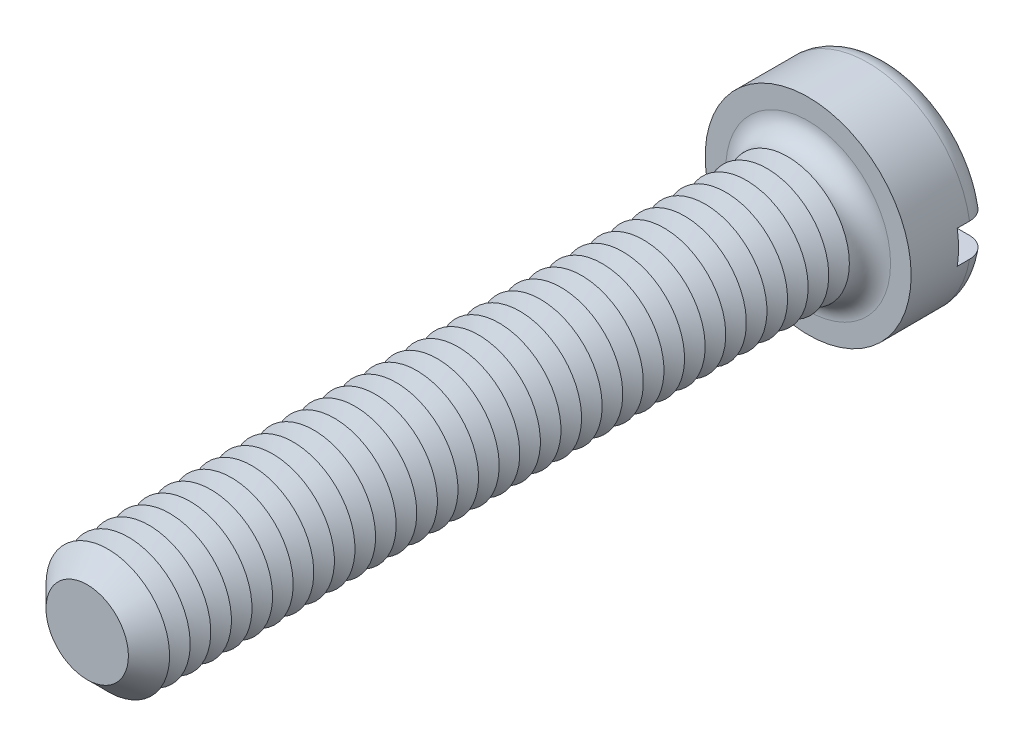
ISO-10303-21;
HEADER;
FILE_DESCRIPTION(('STEP AP214'),'2;1');
FILE_NAME('part.step','',(''),(''),'','','');
FILE_SCHEMA(('AUTOMOTIVE_DESIGN { 1 0 10303 214 1 1 1 1 }'));
ENDSEC;
DATA;
#1=APPLICATION_CONTEXT('core data for automotive mechanical design processes');
#2=APPLICATION_PROTOCOL_DEFINITION('international standard','automotive_design',2000,#1);
#3=PRODUCT_CONTEXT('',#1,'mechanical');
#4=PRODUCT('Part','Part','',(#3));
#5=PRODUCT_RELATED_PRODUCT_CATEGORY('part','',(#4));
#6=PRODUCT_DEFINITION_FORMATION('','',#4);
#7=PRODUCT_DEFINITION_CONTEXT('part definition',#1,'design');
#8=PRODUCT_DEFINITION('design','',#6,#7);
#9=PRODUCT_DEFINITION_SHAPE('','',#8);
#10=(LENGTH_UNIT() NAMED_UNIT(*) SI_UNIT(.MILLI.,.METRE.));
#11=(NAMED_UNIT(*) PLANE_ANGLE_UNIT() SI_UNIT($,.RADIAN.));
#12=(NAMED_UNIT(*) SI_UNIT($,.STERADIAN.) SOLID_ANGLE_UNIT());
#13=UNCERTAINTY_MEASURE_WITH_UNIT(LENGTH_MEASURE(1.E-05),#10,'distance_accuracy_value','');
#14=(GEOMETRIC_REPRESENTATION_CONTEXT(3) GLOBAL_UNCERTAINTY_ASSIGNED_CONTEXT((#13)) GLOBAL_UNIT_ASSIGNED_CONTEXT((#10,
#11,#12)) REPRESENTATION_CONTEXT('',''));
#15=CARTESIAN_POINT('',(0.,0.,0.));
#16=DIRECTION('',(0.,0.,1.));
#17=DIRECTION('',(1.,0.,0.));
#18=AXIS2_PLACEMENT_3D('',#15,#16,#17);
#19=CARTESIAN_POINT('',(0.,0.,-3.9));
#20=DIRECTION('',(0.,0.,1.));
#21=DIRECTION('',(1.,0.,0.));
#22=AXIS2_PLACEMENT_3D('',#19,#20,#21);
#23=PLANE('',#22);
#24=CARTESIAN_POINT('',(0.,0.,-3.9));
#25=DIRECTION('',(0.,0.,1.));
#26=DIRECTION('',(1.,0.,0.));
#27=AXIS2_PLACEMENT_3D('',#24,#25,#26);
#28=CIRCLE('',#27,4.);
#29=CARTESIAN_POINT('',(-3.91918358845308,0.800000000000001,-3.9));
#30=VERTEX_POINT('',#29);
#31=CARTESIAN_POINT('',(3.91918358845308,0.8,-3.9));
#32=VERTEX_POINT('',#31);
#33=EDGE_CURVE('E116',#30,#32,#28,.F.);
#34=ORIENTED_EDGE('',*,*,#33,.T.);
#35=DIRECTION('',(1.,0.,0.));
#36=VECTOR('',#35,1.);
#37=CARTESIAN_POINT('',(-5.,0.800000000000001,-3.9));
#38=LINE('',#37,#36);
#39=EDGE_CURVE('E111',#30,#32,#38,.T.);
#40=ORIENTED_EDGE('',*,*,#39,.F.);
#41=EDGE_LOOP('',(#34,#40));
#42=FACE_BOUND('',#41,.T.);
#43=ADVANCED_FACE('F39',(#42),#23,.F.);
#44=CARTESIAN_POINT('',(0.,0.,-2.9));
#45=DIRECTION('',(0.,0.,1.));
#46=DIRECTION('',(1.,0.,0.));
#47=AXIS2_PLACEMENT_3D('',#44,#45,#46);
#48=TOROIDAL_SURFACE('',#47,4.,1.);
#49=CARTESIAN_POINT('',(-4.76648512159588,0.800000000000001,-3.45304061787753));
#50=CARTESIAN_POINT('',(-4.73486405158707,0.800000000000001,-3.50001565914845));
#51=CARTESIAN_POINT('',(-4.69920787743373,0.800000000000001,-3.54432871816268));
#52=CARTESIAN_POINT('',(-4.62090302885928,0.800000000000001,-3.62634638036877));
#53=CARTESIAN_POINT('',(-4.57824494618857,0.800000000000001,-3.66404194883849));
#54=CARTESIAN_POINT('',(-4.48726975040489,0.800000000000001,-3.73172278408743));
#55=CARTESIAN_POINT('',(-4.43895902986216,0.800000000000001,-3.76171664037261));
#56=CARTESIAN_POINT('',(-4.33804923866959,0.800000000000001,-3.81326437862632));
#57=CARTESIAN_POINT('',(-4.2854512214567,0.800000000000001,-3.8348203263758));
#58=CARTESIAN_POINT('',(-4.17679895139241,0.800000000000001,-3.86918431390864));
#59=CARTESIAN_POINT('',(-4.12071163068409,0.800000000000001,-3.88188775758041));
#60=CARTESIAN_POINT('',(-4.00720729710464,0.800000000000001,-3.89785932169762));
#61=CARTESIAN_POINT('',(-3.94979011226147,0.800000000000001,-3.9011262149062));
#62=CARTESIAN_POINT('',(-3.83429042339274,0.800000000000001,-3.89816676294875));
#63=CARTESIAN_POINT('',(-3.77621176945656,0.800000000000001,-3.89178937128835));
#64=CARTESIAN_POINT('',(-3.66191938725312,0.800000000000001,-3.8694726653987));
#65=CARTESIAN_POINT('',(-3.60570580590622,0.800000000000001,-3.85353259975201));
#66=CARTESIAN_POINT('',(-3.49618749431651,0.800000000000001,-3.81233202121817));
#67=CARTESIAN_POINT('',(-3.44291561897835,0.800000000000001,-3.78698406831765));
#68=CARTESIAN_POINT('',(-3.34140774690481,0.800000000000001,-3.72766098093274));
#69=CARTESIAN_POINT('',(-3.29317182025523,0.800000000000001,-3.69368572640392));
#70=CARTESIAN_POINT('',(-3.20343355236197,0.800000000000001,-3.6182054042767));
#71=CARTESIAN_POINT('',(-3.16189680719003,0.800000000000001,-3.57674128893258));
#72=CARTESIAN_POINT('',(-3.08658236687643,0.800000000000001,-3.48727547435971));
#73=CARTESIAN_POINT('',(-3.05280364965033,0.800000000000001,-3.43927463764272));
#74=CARTESIAN_POINT('',(-2.99489532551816,0.800000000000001,-3.33932895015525));
#75=CARTESIAN_POINT('',(-2.97055012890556,0.800000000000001,-3.28750911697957));
#76=CARTESIAN_POINT('',(-2.93124252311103,0.800000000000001,-3.18042600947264));
#77=CARTESIAN_POINT('',(-2.91627793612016,0.800000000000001,-3.12516353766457));
#78=CARTESIAN_POINT('',(-2.89663075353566,0.800000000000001,-3.01470560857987));
#79=CARTESIAN_POINT('',(-2.89162828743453,0.800000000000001,-2.95956691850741));
#80=CARTESIAN_POINT('',(-2.89112479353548,0.800000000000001,-2.84924961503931));
#81=CARTESIAN_POINT('',(-2.89562264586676,0.800000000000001,-2.79407100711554));
#82=CARTESIAN_POINT('',(-2.91379565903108,0.800000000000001,-2.6861912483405));
#83=CARTESIAN_POINT('',(-2.92731815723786,0.800000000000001,-2.63346424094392));
#84=CARTESIAN_POINT('',(-2.96290888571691,0.800000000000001,-2.53098203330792));
#85=CARTESIAN_POINT('',(-2.98497757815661,0.800000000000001,-2.48122699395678));
#86=CARTESIAN_POINT('',(-3.03728055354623,0.800000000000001,-2.38535286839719));
#87=CARTESIAN_POINT('',(-3.06761989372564,0.800000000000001,-2.33929117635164));
#88=CARTESIAN_POINT('',(-3.13537950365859,0.800000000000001,-2.2527125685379));
#89=CARTESIAN_POINT('',(-3.17280082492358,0.800000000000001,-2.21219647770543));
#90=CARTESIAN_POINT('',(-3.2549164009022,0.800000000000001,-2.13651195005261));
#91=CARTESIAN_POINT('',(-3.29980186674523,0.800000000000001,-2.10155095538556));
#92=CARTESIAN_POINT('',(-3.39467666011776,0.800000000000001,-2.03942270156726));
#93=CARTESIAN_POINT('',(-3.44466673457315,0.800000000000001,-2.01225658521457));
#94=CARTESIAN_POINT('',(-3.5497933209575,0.800000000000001,-1.96576935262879));
#95=CARTESIAN_POINT('',(-3.60503228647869,0.800000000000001,-1.94667963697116));
#96=CARTESIAN_POINT('',(-3.71791613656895,0.800000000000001,-1.91794308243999));
#97=CARTESIAN_POINT('',(-3.77556119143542,0.800000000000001,-1.90829691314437));
#98=CARTESIAN_POINT('',(-3.89221522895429,0.800000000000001,-1.89869331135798));
#99=CARTESIAN_POINT('',(-3.9512319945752,0.800000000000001,-1.89882985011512));
#100=CARTESIAN_POINT('',(-4.06839541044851,0.800000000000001,-1.90907818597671));
#101=CARTESIAN_POINT('',(-4.12654207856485,0.800000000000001,-1.91918977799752));
#102=CARTESIAN_POINT('',(-4.23988103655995,0.800000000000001,-1.9490667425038));
#103=CARTESIAN_POINT('',(-4.29509069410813,0.800000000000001,-1.96876615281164));
#104=CARTESIAN_POINT('',(-4.40134194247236,0.800000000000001,-2.01729572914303));
#105=CARTESIAN_POINT('',(-4.45238383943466,0.800000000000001,-2.04612522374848));
#106=CARTESIAN_POINT('',(-4.54801343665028,0.800000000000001,-2.1116316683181));
#107=CARTESIAN_POINT('',(-4.59268768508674,0.800000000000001,-2.14818225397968));
#108=CARTESIAN_POINT('',(-4.67513924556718,0.800000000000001,-2.22837632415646));
#109=CARTESIAN_POINT('',(-4.71291715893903,0.800000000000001,-2.27201918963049));
#110=CARTESIAN_POINT('',(-4.77986554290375,0.800000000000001,-2.36439990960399));
#111=CARTESIAN_POINT('',(-4.80916462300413,0.800000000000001,-2.41304457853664));
#112=CARTESIAN_POINT('',(-4.85906149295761,0.800000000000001,-2.51460659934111));
#113=CARTESIAN_POINT('',(-4.8796602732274,0.800000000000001,-2.56752346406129));
#114=CARTESIAN_POINT('',(-4.9113264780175,0.800000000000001,-2.67542592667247));
#115=CARTESIAN_POINT('',(-4.92250819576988,0.800000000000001,-2.73037800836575));
#116=CARTESIAN_POINT('',(-4.93542682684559,0.800000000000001,-2.84139649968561));
#117=CARTESIAN_POINT('',(-4.93716171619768,0.800000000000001,-2.89746314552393));
#118=CARTESIAN_POINT('',(-4.93114851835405,0.800000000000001,-3.00876455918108));
#119=CARTESIAN_POINT('',(-4.92345325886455,0.800000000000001,-3.0640022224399));
#120=CARTESIAN_POINT('',(-4.8989032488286,0.800000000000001,-3.17235240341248));
#121=CARTESIAN_POINT('',(-4.88205998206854,0.800000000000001,-3.22546749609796));
#122=CARTESIAN_POINT('',(-4.84819200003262,0.800000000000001,-3.30764066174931));
#123=CARTESIAN_POINT('',(-4.83390853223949,0.800000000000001,-3.33785845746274));
#124=CARTESIAN_POINT('',(-4.80237957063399,0.800000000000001,-3.39670633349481));
#125=CARTESIAN_POINT('',(-4.78513409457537,0.800000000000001,-3.42533642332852));
#126=CARTESIAN_POINT('',(-4.76648512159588,0.800000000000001,-3.45304061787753));
#127=B_SPLINE_CURVE_WITH_KNOTS('',3,(#49,#50,#51,#52,#53,#54,#55,#56,#57,#58,#59,#60,#61,#62,
#63,#64,#65,#66,#67,#68,#69,#70,#71,#72,#73,#74,#75,#76,#77,#78,#79,#80,#81,#82,#83,#84,#85,#86,
#87,#88,#89,#90,#91,#92,#93,#94,#95,#96,#97,#98,#99,#100,#101,#102,#103,#104,#105,#106,#107,
#108,#109,#110,#111,#112,#113,#114,#115,#116,#117,#118,#119,#120,#121,#122,#123,#124,#125,#126),
.UNSPECIFIED.,.T.,.F.,(4,2,2,2,2,2,2,2,2,2,2,2,2,2,2,2,2,2,2,2,2,2,2,2,2,2,2,2,2,2,2,2,2,2,2,2,
2,2,4),(0.,0.169755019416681,0.339740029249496,0.509534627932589,0.67928763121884,
0.851013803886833,1.02276230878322,1.19722869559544,1.37170879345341,1.54785292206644,
1.72399950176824,1.89921049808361,2.07439839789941,2.24530597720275,2.41617386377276,
2.58146078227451,2.74672821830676,2.90926852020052,3.0718176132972,3.2365363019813,
3.40127946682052,3.57118676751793,3.74111896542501,3.91563534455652,4.09016409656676,
4.26636956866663,4.4425714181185,4.61757781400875,4.79257134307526,4.96489650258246,
5.13720662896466,5.30674670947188,5.47626748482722,5.64369988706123,5.81116816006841,
5.97770254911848,6.14402836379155,6.24414438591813,6.34425980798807),.UNSPECIFIED.);
#128=CARTESIAN_POINT('',(-4.93558507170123,0.800000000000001,-2.9));
#129=VERTEX_POINT('',#128);
#130=EDGE_CURVE('E443',#129,#30,#127,.T.);
#131=ORIENTED_EDGE('',*,*,#130,.F.);
#132=CARTESIAN_POINT('',(0.,0.,-2.9));
#133=DIRECTION('',(0.,0.,1.));
#134=DIRECTION('',(1.,0.,0.));
#135=AXIS2_PLACEMENT_3D('',#132,#133,#134);
#136=CIRCLE('',#135,5.);
#137=CARTESIAN_POINT('',(4.93558507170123,0.8,-2.9));
#138=VERTEX_POINT('',#137);
#139=EDGE_CURVE('E125',#138,#129,#136,.T.);
#140=ORIENTED_EDGE('',*,*,#139,.F.);
#141=CARTESIAN_POINT('',(2.98553785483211,0.8,-3.31649797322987));
#142=CARTESIAN_POINT('',(3.00991125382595,0.8,-3.36788093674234));
#143=CARTESIAN_POINT('',(3.03875556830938,0.8,-3.41719756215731));
#144=CARTESIAN_POINT('',(3.1043993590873,0.8,-3.51028676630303));
#145=CARTESIAN_POINT('',(3.1412115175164,0.8,-3.55405032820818));
#146=CARTESIAN_POINT('',(3.22153641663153,0.8,-3.63476402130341));
#147=CARTESIAN_POINT('',(3.26503706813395,0.8,-3.67172618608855));
#148=CARTESIAN_POINT('',(3.35749627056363,0.8,-3.73799476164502));
#149=CARTESIAN_POINT('',(3.4064533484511,0.8,-3.76730323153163));
#150=CARTESIAN_POINT('',(3.5095773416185,0.8,-3.81809642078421));
#151=CARTESIAN_POINT('',(3.56383317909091,0.8,-3.83940072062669));
#152=CARTESIAN_POINT('',(3.67513017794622,0.8,-3.87272481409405));
#153=CARTESIAN_POINT('',(3.7321717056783,0.8,-3.88474338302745));
#154=CARTESIAN_POINT('',(3.84815688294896,0.8,-3.89923413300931));
#155=CARTESIAN_POINT('',(3.90711516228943,0.8,-3.9015896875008));
#156=CARTESIAN_POINT('',(4.02458610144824,0.8,-3.89631753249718));
#157=CARTESIAN_POINT('',(4.08309876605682,0.8,-3.8886899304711));
#158=CARTESIAN_POINT('',(4.19768646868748,0.8,-3.86366584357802));
#159=CARTESIAN_POINT('',(4.25377243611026,0.8,-3.84631948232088));
#160=CARTESIAN_POINT('',(4.3621676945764,0.8,-3.80231797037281));
#161=CARTESIAN_POINT('',(4.41447726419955,0.8,-3.77566350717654));
#162=CARTESIAN_POINT('',(4.51300872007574,0.8,-3.71421163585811));
#163=CARTESIAN_POINT('',(4.5593085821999,0.8,-3.67953927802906));
#164=CARTESIAN_POINT('',(4.64530675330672,0.8,-3.60279495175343));
#165=CARTESIAN_POINT('',(4.68500564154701,0.8,-3.56072363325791));
#166=CARTESIAN_POINT('',(4.75599202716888,0.8,-3.47111750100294));
#167=CARTESIAN_POINT('',(4.7874061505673,0.8,-3.42368298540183));
#168=CARTESIAN_POINT('',(4.84170328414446,0.8,-3.32415927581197));
#169=CARTESIAN_POINT('',(4.86458695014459,0.8,-3.2720704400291));
#170=CARTESIAN_POINT('',(4.90088120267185,0.8,-3.16544016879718));
#171=CARTESIAN_POINT('',(4.91440984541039,0.8,-3.11093889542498));
#172=CARTESIAN_POINT('',(4.93205429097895,0.8,-3.00043391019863));
#173=CARTESIAN_POINT('',(4.93617053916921,0.8,-2.9444302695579));
#174=CARTESIAN_POINT('',(4.93486973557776,0.8,-2.83292218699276));
#175=CARTESIAN_POINT('',(4.92951827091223,0.8,-2.77741696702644));
#176=CARTESIAN_POINT('',(4.90957104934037,0.8,-2.66809456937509));
#177=CARTESIAN_POINT('',(4.89497541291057,0.8,-2.61427736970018));
#178=CARTESIAN_POINT('',(4.85697876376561,0.8,-2.50985095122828));
#179=CARTESIAN_POINT('',(4.83357805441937,0.8,-2.45924162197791));
#180=CARTESIAN_POINT('',(4.77866660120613,0.8,-2.36263484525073));
#181=CARTESIAN_POINT('',(4.74715567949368,0.8,-2.31663749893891));
#182=CARTESIAN_POINT('',(4.67670791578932,0.8,-2.23021464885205));
#183=CARTESIAN_POINT('',(4.6377224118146,0.8,-2.1898288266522));
#184=CARTESIAN_POINT('',(4.55359880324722,0.8,-2.11607828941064));
#185=CARTESIAN_POINT('',(4.50846036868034,0.8,-2.08271395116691));
#186=CARTESIAN_POINT('',(4.41271544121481,0.8,-2.02349513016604));
#187=CARTESIAN_POINT('',(4.36204749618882,0.8,-1.99774003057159));
#188=CARTESIAN_POINT('',(4.257155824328,0.8,-1.95495040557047));
#189=CARTESIAN_POINT('',(4.20293181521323,0.8,-1.93791657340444));
#190=CARTESIAN_POINT('',(4.09154156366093,0.8,-1.91276335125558));
#191=CARTESIAN_POINT('',(4.03434212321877,0.8,-1.90479098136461));
#192=CARTESIAN_POINT('',(3.91941228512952,0.8,-1.89840884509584));
#193=CARTESIAN_POINT('',(3.8616818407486,0.8,-1.89999992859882));
#194=CARTESIAN_POINT('',(3.7464111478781,0.8,-1.91275144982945));
#195=CARTESIAN_POINT('',(3.6888866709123,0.8,-1.92405471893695));
#196=CARTESIAN_POINT('',(3.57652290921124,0.8,-1.95609086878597));
#197=CARTESIAN_POINT('',(3.52168382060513,0.8,-1.97682443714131));
#198=CARTESIAN_POINT('',(3.41589179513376,0.8,-2.02733294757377));
#199=CARTESIAN_POINT('',(3.36496676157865,0.8,-2.05716640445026));
#200=CARTESIAN_POINT('',(3.26890903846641,0.8,-2.12504079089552));
#201=CARTESIAN_POINT('',(3.22377627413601,0.8,-2.16308161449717));
#202=CARTESIAN_POINT('',(3.141135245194,0.8,-2.24593284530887));
#203=CARTESIAN_POINT('',(3.1035541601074,0.8,-2.29067053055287));
#204=CARTESIAN_POINT('',(3.03669700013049,0.8,-2.38597317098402));
#205=CARTESIAN_POINT('',(3.00741914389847,0.8,-2.43653687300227));
#206=CARTESIAN_POINT('',(2.95891799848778,0.8,-2.54052959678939));
#207=CARTESIAN_POINT('',(2.93943249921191,0.8,-2.59383627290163));
#208=CARTESIAN_POINT('',(2.9100081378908,0.8,-2.70303736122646));
#209=CARTESIAN_POINT('',(2.90006970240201,0.8,-2.75893188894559));
#210=CARTESIAN_POINT('',(2.89027863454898,0.8,-2.86986958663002));
#211=CARTESIAN_POINT('',(2.89012791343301,0.8,-2.92488680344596));
#212=CARTESIAN_POINT('',(2.89917145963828,0.8,-3.03409648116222));
#213=CARTESIAN_POINT('',(2.90835313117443,0.8,-3.08828995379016));
#214=CARTESIAN_POINT('',(2.92977618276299,0.8,-3.17141652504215));
#215=CARTESIAN_POINT('',(2.93899011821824,0.8,-3.20116372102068));
#216=CARTESIAN_POINT('',(2.96020249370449,0.8,-3.25964614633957));
#217=CARTESIAN_POINT('',(2.97220082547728,0.8,-3.28838141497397));
#218=CARTESIAN_POINT('',(2.98553785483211,0.8,-3.31649797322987));
#219=B_SPLINE_CURVE_WITH_KNOTS('',3,(#141,#142,#143,#144,#145,#146,#147,#148,#149,#150,#151,
#152,#153,#154,#155,#156,#157,#158,#159,#160,#161,#162,#163,#164,#165,#166,#167,#168,#169,#170,
#171,#172,#173,#174,#175,#176,#177,#178,#179,#180,#181,#182,#183,#184,#185,#186,#187,#188,#189,
#190,#191,#192,#193,#194,#195,#196,#197,#198,#199,#200,#201,#202,#203,#204,#205,#206,#207,#208,
#209,#210,#211,#212,#213,#214,#215,#216,#217,#218),.UNSPECIFIED.,.T.,.F.,(4,2,2,2,2,2,2,2,2,2,2,
2,2,2,2,2,2,2,2,2,2,2,2,2,2,2,2,2,2,2,2,2,2,2,2,2,2,2,4),(0.,0.170493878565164,
0.341261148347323,0.511723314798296,0.682139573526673,0.856194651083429,1.03027268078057,
1.20644565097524,1.38261672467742,1.55788746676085,1.73314526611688,1.90583484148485,
2.07850925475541,2.24836742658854,2.41821253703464,2.58587311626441,2.75352576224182,
2.92002154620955,3.08651516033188,3.25300303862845,3.41949456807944,3.58710926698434,
3.75473295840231,3.92445790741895,4.09419634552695,4.26665110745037,4.43912119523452,
4.61417197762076,4.78923552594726,4.96544940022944,5.1416609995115,5.31608191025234,
5.49046537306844,5.65989063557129,5.82932346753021,5.99359365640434,6.157642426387,
6.250939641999,6.34423323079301),.UNSPECIFIED.);
#220=EDGE_CURVE('E445',#32,#138,#219,.T.);
#221=ORIENTED_EDGE('',*,*,#220,.F.);
#222=ORIENTED_EDGE('',*,*,#33,.F.);
#223=EDGE_LOOP('',(#131,#140,#221,#222));
#224=FACE_BOUND('',#223,.T.);
#225=ADVANCED_FACE('F427',(#224),#48,.T.);
#226=CARTESIAN_POINT('',(0.,0.,-3.9));
#227=DIRECTION('',(0.,0.,1.));
#228=DIRECTION('',(1.,0.,0.));
#229=AXIS2_PLACEMENT_3D('',#226,#227,#228);
#230=CYLINDRICAL_SURFACE('',#229,5.);
#231=DIRECTION('',(0.,0.,1.));
#232=VECTOR('',#231,1.);
#233=CARTESIAN_POINT('',(4.93558507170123,0.8,-3.9));
#234=LINE('',#233,#232);
#235=CARTESIAN_POINT('',(4.93558507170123,0.8,-2.3));
#236=VERTEX_POINT('',#235);
#237=EDGE_CURVE('E460',#138,#236,#234,.T.);
#238=ORIENTED_EDGE('',*,*,#237,.F.);
#239=ORIENTED_EDGE('',*,*,#139,.T.);
#240=DIRECTION('',(0.,0.,1.));
#241=VECTOR('',#240,1.);
#242=CARTESIAN_POINT('',(-4.93558507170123,0.800000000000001,-3.9));
#243=LINE('',#242,#241);
#244=CARTESIAN_POINT('',(-4.93558507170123,0.800000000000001,-2.3));
#245=VERTEX_POINT('',#244);
#246=EDGE_CURVE('E63',#245,#129,#243,.F.);
#247=ORIENTED_EDGE('',*,*,#246,.F.);
#248=CARTESIAN_POINT('',(0.,0.,-2.3));
#249=DIRECTION('',(0.,0.,-1.));
#250=DIRECTION('',(-1.,0.,0.));
#251=AXIS2_PLACEMENT_3D('',#248,#249,#250);
#252=CIRCLE('',#251,5.);
#253=CARTESIAN_POINT('',(-4.93558507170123,-0.799999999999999,-2.3));
#254=VERTEX_POINT('',#253);
#255=EDGE_CURVE('E43',#245,#254,#252,.F.);
#256=ORIENTED_EDGE('',*,*,#255,.T.);
#257=DIRECTION('',(0.,0.,1.));
#258=VECTOR('',#257,1.);
#259=CARTESIAN_POINT('',(-4.93558507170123,-0.799999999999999,-3.9));
#260=LINE('',#259,#258);
#261=CARTESIAN_POINT('',(-4.93558507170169,-0.799999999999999,-2.89999999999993));
#262=VERTEX_POINT('',#261);
#263=EDGE_CURVE('E457',#262,#254,#260,.T.);
#264=ORIENTED_EDGE('',*,*,#263,.F.);
#265=CARTESIAN_POINT('',(4.93558507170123,-0.8,-2.9));
#266=VERTEX_POINT('',#265);
#267=EDGE_CURVE('E127',#262,#266,#136,.T.);
#268=ORIENTED_EDGE('',*,*,#267,.T.);
#269=DIRECTION('',(0.,0.,1.));
#270=VECTOR('',#269,1.);
#271=CARTESIAN_POINT('',(4.93558507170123,-0.8,-3.9));
#272=LINE('',#271,#270);
#273=CARTESIAN_POINT('',(4.93558507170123,-0.8,-2.3));
#274=VERTEX_POINT('',#273);
#275=EDGE_CURVE('E55',#274,#266,#272,.F.);
#276=ORIENTED_EDGE('',*,*,#275,.F.);
#277=EDGE_CURVE('E11',#274,#236,#252,.F.);
#278=ORIENTED_EDGE('',*,*,#277,.T.);
#279=EDGE_LOOP('',(#238,#239,#247,#256,#264,#268,#276,#278));
#280=FACE_BOUND('',#279,.T.);
#281=CARTESIAN_POINT('',(0.,0.,0.));
#282=DIRECTION('',(0.,0.,1.));
#283=DIRECTION('',(1.,0.,0.));
#284=AXIS2_PLACEMENT_3D('',#281,#282,#283);
#285=CIRCLE('',#284,5.);
#286=CARTESIAN_POINT('',(5.,0.,0.));
#287=VERTEX_POINT('',#286);
#288=EDGE_CURVE('E463',#287,#287,#285,.T.);
#289=ORIENTED_EDGE('',*,*,#288,.F.);
#290=EDGE_LOOP('',(#289));
#291=FACE_BOUND('',#290,.T.);
#292=ADVANCED_FACE('F423',(#280,#291),#230,.T.);
#293=CARTESIAN_POINT('',(3.91918358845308,-0.8,-3.9));
#294=VERTEX_POINT('',#293);
#295=CARTESIAN_POINT('',(-3.91918358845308,-0.799999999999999,-3.9));
#296=VERTEX_POINT('',#295);
#297=EDGE_CURVE('E109',#294,#296,#28,.F.);
#298=ORIENTED_EDGE('',*,*,#297,.T.);
#299=DIRECTION('',(-1.,0.,0.));
#300=VECTOR('',#299,1.);
#301=CARTESIAN_POINT('',(-5.,-0.799999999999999,-3.9));
#302=LINE('',#301,#300);
#303=EDGE_CURVE('E96',#294,#296,#302,.T.);
#304=ORIENTED_EDGE('',*,*,#303,.F.);
#305=EDGE_LOOP('',(#298,#304));
#306=FACE_BOUND('',#305,.T.);
#307=ADVANCED_FACE('F108',(#306),#23,.F.);
#308=CARTESIAN_POINT('',(0.,0.,0.));
#309=DIRECTION('',(0.,0.,1.));
#310=DIRECTION('',(1.,0.,0.));
#311=AXIS2_PLACEMENT_3D('',#308,#309,#310);
#312=PLANE('',#311);
#313=CARTESIAN_POINT('',(0.,0.,0.));
#314=DIRECTION('',(0.,0.,1.));
#315=DIRECTION('',(1.,0.,0.));
#316=AXIS2_PLACEMENT_3D('',#313,#314,#315);
#317=CIRCLE('',#316,4.);
#318=CARTESIAN_POINT('',(4.,0.,0.));
#319=VERTEX_POINT('',#318);
#320=EDGE_CURVE('E115',#319,#319,#317,.F.);
#321=ORIENTED_EDGE('',*,*,#320,.T.);
#322=EDGE_LOOP('',(#321));
#323=FACE_BOUND('',#322,.T.);
#324=ORIENTED_EDGE('',*,*,#288,.T.);
#325=EDGE_LOOP('',(#324));
#326=FACE_BOUND('',#325,.T.);
#327=ADVANCED_FACE('F422',(#323,#326),#312,.T.);
#328=CARTESIAN_POINT('',(-4.76648512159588,-0.799999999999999,-3.45304061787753));
#329=CARTESIAN_POINT('',(-4.7975694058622,-0.799999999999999,-3.40685392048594));
#330=CARTESIAN_POINT('',(-4.82479903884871,-0.799999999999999,-3.35802740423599));
#331=CARTESIAN_POINT('',(-4.87070632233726,-0.799999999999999,-3.25646127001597));
#332=CARTESIAN_POINT('',(-4.8893747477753,-0.799999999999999,-3.20371750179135));
#333=CARTESIAN_POINT('',(-4.91756720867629,-0.799999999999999,-3.09584501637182));
#334=CARTESIAN_POINT('',(-4.92709302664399,-0.799999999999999,-3.04071676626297));
#335=CARTESIAN_POINT('',(-4.93671217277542,-0.799999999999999,-2.92965669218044));
#336=CARTESIAN_POINT('',(-4.93680767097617,-0.799999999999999,-2.87372505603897));
#337=CARTESIAN_POINT('',(-4.92758675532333,-0.799999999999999,-2.76284675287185));
#338=CARTESIAN_POINT('',(-4.91830421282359,-0.799999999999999,-2.70789726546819));
#339=CARTESIAN_POINT('',(-4.89065741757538,-0.799999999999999,-2.60033228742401));
#340=CARTESIAN_POINT('',(-4.87229291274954,-0.799999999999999,-2.54771686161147));
#341=CARTESIAN_POINT('',(-4.82699855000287,-0.799999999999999,-2.44622441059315));
#342=CARTESIAN_POINT('',(-4.80005659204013,-0.799999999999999,-2.39735278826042));
#343=CARTESIAN_POINT('',(-4.73841244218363,-0.799999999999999,-2.30477947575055));
#344=CARTESIAN_POINT('',(-4.70371003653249,-0.799999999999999,-2.26107792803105));
#345=CARTESIAN_POINT('',(-4.62724516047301,-0.799999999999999,-2.17969334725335));
#346=CARTESIAN_POINT('',(-4.58542787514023,-0.799999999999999,-2.14206183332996));
#347=CARTESIAN_POINT('',(-4.49614171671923,-0.799999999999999,-2.07424284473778));
#348=CARTESIAN_POINT('',(-4.44867251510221,-0.799999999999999,-2.04405580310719));
#349=CARTESIAN_POINT('',(-4.34875035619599,-0.799999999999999,-1.99153688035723));
#350=CARTESIAN_POINT('',(-4.29623870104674,-0.799999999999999,-1.96931670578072));
#351=CARTESIAN_POINT('',(-4.18826905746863,-0.799999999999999,-1.93384994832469));
#352=CARTESIAN_POINT('',(-4.1328108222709,-0.799999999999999,-1.92060411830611));
#353=CARTESIAN_POINT('',(-4.01956054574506,-0.799999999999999,-1.90323798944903));
#354=CARTESIAN_POINT('',(-3.96174522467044,-0.799999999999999,-1.89926947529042));
#355=CARTESIAN_POINT('',(-3.84625419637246,-0.799999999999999,-1.90095183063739));
#356=CARTESIAN_POINT('',(-3.78857850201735,-0.799999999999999,-1.90660355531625));
#357=CARTESIAN_POINT('',(-3.67415602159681,-0.799999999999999,-1.92748272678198));
#358=CARTESIAN_POINT('',(-3.61743328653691,-0.799999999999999,-1.94284216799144));
#359=CARTESIAN_POINT('',(-3.50734962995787,-0.799999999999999,-1.9828275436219));
#360=CARTESIAN_POINT('',(-3.4539889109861,-0.799999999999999,-2.00745403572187));
#361=CARTESIAN_POINT('',(-3.35197118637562,-0.799999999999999,-2.06542964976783));
#362=CARTESIAN_POINT('',(-3.30333217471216,-0.799999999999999,-2.0988104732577));
#363=CARTESIAN_POINT('',(-3.21244692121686,-0.799999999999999,-2.17337326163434));
#364=CARTESIAN_POINT('',(-3.17020039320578,-0.799999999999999,-2.21455487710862));
#365=CARTESIAN_POINT('',(-3.0940098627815,-0.799999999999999,-2.30296695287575));
#366=CARTESIAN_POINT('',(-3.05995540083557,-0.799999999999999,-2.35010211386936));
#367=CARTESIAN_POINT('',(-3.00053815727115,-0.799999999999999,-2.4495670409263));
#368=CARTESIAN_POINT('',(-2.97517362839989,-0.799999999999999,-2.50189576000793));
#369=CARTESIAN_POINT('',(-2.93470320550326,-0.799999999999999,-2.60853979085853));
#370=CARTESIAN_POINT('',(-2.91930557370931,-0.799999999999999,-2.66274437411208));
#371=CARTESIAN_POINT('',(-2.89812734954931,-0.799999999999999,-2.77299836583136));
#372=CARTESIAN_POINT('',(-2.89234481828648,-0.799999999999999,-2.82904740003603));
#373=CARTESIAN_POINT('',(-2.89064073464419,-0.799999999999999,-2.93970612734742));
#374=CARTESIAN_POINT('',(-2.89444549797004,-0.799999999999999,-2.99431180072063));
#375=CARTESIAN_POINT('',(-2.9112006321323,-0.799999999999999,-3.10209766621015));
#376=CARTESIAN_POINT('',(-2.9241507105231,-0.799999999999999,-3.1552779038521));
#377=CARTESIAN_POINT('',(-2.95868580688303,-0.799999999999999,-3.25858631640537));
#378=CARTESIAN_POINT('',(-2.98024709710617,-0.799999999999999,-3.30872244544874));
#379=CARTESIAN_POINT('',(-3.03128544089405,-0.799999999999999,-3.40478519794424));
#380=CARTESIAN_POINT('',(-3.06076335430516,-0.799999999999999,-3.45071136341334));
#381=CARTESIAN_POINT('',(-3.12753448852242,-0.799999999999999,-3.53826932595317));
#382=CARTESIAN_POINT('',(-3.16500083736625,-0.799999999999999,-3.57976901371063));
#383=CARTESIAN_POINT('',(-3.24617503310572,-0.799999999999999,-3.65613204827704));
#384=CARTESIAN_POINT('',(-3.28988388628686,-0.799999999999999,-3.69099432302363));
#385=CARTESIAN_POINT('',(-3.38380639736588,-0.799999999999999,-3.75424083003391));
#386=CARTESIAN_POINT('',(-3.43418287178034,-0.799999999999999,-3.78238342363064));
#387=CARTESIAN_POINT('',(-3.53887888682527,-0.799999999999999,-3.83000231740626));
#388=CARTESIAN_POINT('',(-3.59319889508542,-0.799999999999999,-3.84947758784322));
#389=CARTESIAN_POINT('',(-3.70539237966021,-0.799999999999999,-3.87954336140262));
#390=CARTESIAN_POINT('',(-3.76331464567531,-0.799999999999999,-3.88995217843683));
#391=CARTESIAN_POINT('',(-3.88008461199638,-0.799999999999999,-3.9009132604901));
#392=CARTESIAN_POINT('',(-3.93893230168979,-0.799999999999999,-3.9014656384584));
#393=CARTESIAN_POINT('',(-4.05594892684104,-0.799999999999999,-3.89264187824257));
#394=CARTESIAN_POINT('',(-4.11411702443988,-0.799999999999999,-3.88325457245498));
#395=CARTESIAN_POINT('',(-4.22802928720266,-0.799999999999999,-3.85472582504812));
#396=CARTESIAN_POINT('',(-4.28377297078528,-0.799999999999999,-3.83558245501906));
#397=CARTESIAN_POINT('',(-4.39054463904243,-0.799999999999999,-3.78829842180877));
#398=CARTESIAN_POINT('',(-4.44161887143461,-0.799999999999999,-3.76026208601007));
#399=CARTESIAN_POINT('',(-4.53818016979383,-0.799999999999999,-3.69589278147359));
#400=CARTESIAN_POINT('',(-4.58367442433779,-0.799999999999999,-3.65957066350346));
#401=CARTESIAN_POINT('',(-4.65208830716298,-0.799999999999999,-3.59453310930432));
#402=CARTESIAN_POINT('',(-4.67711825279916,-0.799999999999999,-3.56800018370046));
#403=CARTESIAN_POINT('',(-4.72414423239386,-0.799999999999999,-3.51236863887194));
#404=CARTESIAN_POINT('',(-4.74614029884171,-0.799999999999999,-3.48327004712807));
#405=CARTESIAN_POINT('',(-4.76648512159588,-0.799999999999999,-3.45304061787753));
#406=B_SPLINE_CURVE_WITH_KNOTS('',3,(#328,#329,#330,#331,#332,#333,#334,#335,#336,#337,#338,
#339,#340,#341,#342,#343,#344,#345,#346,#347,#348,#349,#350,#351,#352,#353,#354,#355,#356,#357,
#358,#359,#360,#361,#362,#363,#364,#365,#366,#367,#368,#369,#370,#371,#372,#373,#374,#375,#376,
#377,#378,#379,#380,#381,#382,#383,#384,#385,#386,#387,#388,#389,#390,#391,#392,#393,#394,#395,
#396,#397,#398,#399,#400,#401,#402,#403,#404,#405),.UNSPECIFIED.,.T.,.F.,(4,2,2,2,2,2,2,2,2,2,2,
2,2,2,2,2,2,2,2,2,2,2,2,2,2,2,2,2,2,2,2,2,2,2,2,2,2,2,4),(0.,0.166886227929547,
0.333951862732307,0.500984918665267,0.667979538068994,0.834373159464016,1.00077139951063,
1.16740542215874,1.33404403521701,1.50202999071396,1.67002571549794,1.84029248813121,
2.01057354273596,2.18362161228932,2.35668506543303,2.53215380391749,2.70763310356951,
2.88375684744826,3.05987270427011,3.23346085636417,3.40701408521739,3.57522519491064,
3.74340238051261,3.90683338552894,4.0702591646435,4.23323770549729,4.39623395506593,
4.56320691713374,4.7302068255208,4.90252468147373,5.07486300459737,5.25058028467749,
5.42629555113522,5.60220844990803,5.77815613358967,5.95211162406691,6.12584060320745,
6.23506966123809,6.34429754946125),.UNSPECIFIED.);
#407=EDGE_CURVE('E103',#296,#262,#406,.T.);
#408=ORIENTED_EDGE('',*,*,#407,.F.);
#409=ORIENTED_EDGE('',*,*,#297,.F.);
#410=CARTESIAN_POINT('',(2.98553785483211,-0.8,-3.31649797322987));
#411=CARTESIAN_POINT('',(2.96216773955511,-0.8,-3.26721849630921));
#412=CARTESIAN_POINT('',(2.94287503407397,-0.8,-3.21596872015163));
#413=CARTESIAN_POINT('',(2.91313258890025,-0.8,-3.11092723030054));
#414=CARTESIAN_POINT('',(2.9026902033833,-0.8,-3.0571334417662));
#415=CARTESIAN_POINT('',(2.89104377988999,-0.8,-2.94853922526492));
#416=CARTESIAN_POINT('',(2.88984130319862,-0.8,-2.89373862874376));
#417=CARTESIAN_POINT('',(2.89672585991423,-0.8,-2.78473646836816));
#418=CARTESIAN_POINT('',(2.90481120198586,-0.8,-2.73053479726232));
#419=CARTESIAN_POINT('',(2.92989134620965,-0.8,-2.62460092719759));
#420=CARTESIAN_POINT('',(2.94682969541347,-0.8,-2.57285532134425));
#421=CARTESIAN_POINT('',(2.9889990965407,-0.8,-2.47286425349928));
#422=CARTESIAN_POINT('',(3.01423103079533,-0.8,-2.42461916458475));
#423=CARTESIAN_POINT('',(3.07271536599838,-0.8,-2.33201565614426));
#424=CARTESIAN_POINT('',(3.10610710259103,-0.8,-2.28774532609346));
#425=CARTESIAN_POINT('',(3.17963417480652,-0.8,-2.205215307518));
#426=CARTESIAN_POINT('',(3.21977054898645,-0.8,-2.16695654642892));
#427=CARTESIAN_POINT('',(3.3070361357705,-0.8,-2.09624274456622));
#428=CARTESIAN_POINT('',(3.35434874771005,-0.8,-2.06401396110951));
#429=CARTESIAN_POINT('',(3.45361131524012,-0.8,-2.00773436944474));
#430=CARTESIAN_POINT('',(3.50556189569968,-0.8,-1.98368466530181));
#431=CARTESIAN_POINT('',(3.61398433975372,-0.8,-1.94389460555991));
#432=CARTESIAN_POINT('',(3.67053506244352,-0.8,-1.92836880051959));
#433=CARTESIAN_POINT('',(3.78543606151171,-0.8,-1.90696594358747));
#434=CARTESIAN_POINT('',(3.84378643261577,-0.8,-1.90108940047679));
#435=CARTESIAN_POINT('',(3.96100201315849,-0.8,-1.89918115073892));
#436=CARTESIAN_POINT('',(4.01986821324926,-0.8,-1.90320860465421));
#437=CARTESIAN_POINT('',(4.13606891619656,-0.8,-1.9211820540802));
#438=CARTESIAN_POINT('',(4.19340347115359,-0.8,-1.93512771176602));
#439=CARTESIAN_POINT('',(4.30434213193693,-0.8,-1.97243705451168));
#440=CARTESIAN_POINT('',(4.35797549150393,-0.8,-1.99571368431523));
#441=CARTESIAN_POINT('',(4.46048254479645,-0.8,-2.0510826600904));
#442=CARTESIAN_POINT('',(4.50935662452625,-0.8,-2.08317429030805));
#443=CARTESIAN_POINT('',(4.60012348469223,-0.8,-2.15471647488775));
#444=CARTESIAN_POINT('',(4.64211506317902,-0.8,-2.19404167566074));
#445=CARTESIAN_POINT('',(4.71877054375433,-0.8,-2.27928299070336));
#446=CARTESIAN_POINT('',(4.75343508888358,-0.8,-2.32519852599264));
#447=CARTESIAN_POINT('',(4.81388799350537,-0.8,-2.4215411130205));
#448=CARTESIAN_POINT('',(4.83980652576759,-0.8,-2.47188650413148));
#449=CARTESIAN_POINT('',(4.88271402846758,-0.8,-2.57624865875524));
#450=CARTESIAN_POINT('',(4.89970360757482,-0.8,-2.63026517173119));
#451=CARTESIAN_POINT('',(4.92409334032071,-0.8,-2.73978844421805));
#452=CARTESIAN_POINT('',(4.93159814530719,-0.8,-2.79527191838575));
#453=CARTESIAN_POINT('',(4.93713723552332,-0.8,-2.90670881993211));
#454=CARTESIAN_POINT('',(4.9351718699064,-0.8,-2.9626622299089));
#455=CARTESIAN_POINT('',(4.92186293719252,-0.8,-3.07317093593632));
#456=CARTESIAN_POINT('',(4.91056393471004,-0.8,-3.12773160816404));
#457=CARTESIAN_POINT('',(4.87898532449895,-0.8,-3.234187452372));
#458=CARTESIAN_POINT('',(4.85870572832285,-0.8,-3.28608262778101));
#459=CARTESIAN_POINT('',(4.80971634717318,-0.8,-3.38586723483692));
#460=CARTESIAN_POINT('',(4.78098824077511,-0.8,-3.43374766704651));
#461=CARTESIAN_POINT('',(4.71596686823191,-0.8,-3.52405937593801));
#462=CARTESIAN_POINT('',(4.67967336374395,-0.8,-3.56649048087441));
#463=CARTESIAN_POINT('',(4.60022577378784,-0.8,-3.64511036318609));
#464=CARTESIAN_POINT('',(4.5570143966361,-0.8,-3.6812412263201));
#465=CARTESIAN_POINT('',(4.4652099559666,-0.8,-3.7458530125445));
#466=CARTESIAN_POINT('',(4.41661654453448,-0.8,-3.77433344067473));
#467=CARTESIAN_POINT('',(4.31470683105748,-0.8,-3.82326981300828));
#468=CARTESIAN_POINT('',(4.26133399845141,-0.8,-3.84360800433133));
#469=CARTESIAN_POINT('',(4.15196444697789,-0.8,-3.87519515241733));
#470=CARTESIAN_POINT('',(4.09596750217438,-0.8,-3.88644332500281));
#471=CARTESIAN_POINT('',(3.98196469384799,-0.8,-3.89971870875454));
#472=CARTESIAN_POINT('',(3.92394096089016,-0.8,-3.901592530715));
#473=CARTESIAN_POINT('',(3.8083852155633,-0.8,-3.89570840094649));
#474=CARTESIAN_POINT('',(3.75085322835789,-0.8,-3.88794995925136));
#475=CARTESIAN_POINT('',(3.6371167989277,-0.8,-3.86287824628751));
#476=CARTESIAN_POINT('',(3.58093962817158,-0.8,-3.84544111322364));
#477=CARTESIAN_POINT('',(3.47227948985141,-0.8,-3.80139971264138));
#478=CARTESIAN_POINT('',(3.41979762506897,-0.8,-3.77479272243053));
#479=CARTESIAN_POINT('',(3.31994061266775,-0.8,-3.71304199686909));
#480=CARTESIAN_POINT('',(3.27257854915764,-0.8,-3.67787710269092));
#481=CARTESIAN_POINT('',(3.18459619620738,-0.8,-3.59999704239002));
#482=CARTESIAN_POINT('',(3.14396747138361,-0.8,-3.55729146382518));
#483=CARTESIAN_POINT('',(3.08341110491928,-0.8,-3.48140072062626));
#484=CARTESIAN_POINT('',(3.06118126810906,-0.8,-3.45002448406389));
#485=CARTESIAN_POINT('',(3.02047302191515,-0.8,-3.38492378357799));
#486=CARTESIAN_POINT('',(3.00199451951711,-0.8,-3.35119937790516));
#487=CARTESIAN_POINT('',(2.98553785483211,-0.8,-3.31649797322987));
#488=B_SPLINE_CURVE_WITH_KNOTS('',3,(#410,#411,#412,#413,#414,#415,#416,#417,#418,#419,#420,
#421,#422,#423,#424,#425,#426,#427,#428,#429,#430,#431,#432,#433,#434,#435,#436,#437,#438,#439,
#440,#441,#442,#443,#444,#445,#446,#447,#448,#449,#450,#451,#452,#453,#454,#455,#456,#457,#458,
#459,#460,#461,#462,#463,#464,#465,#466,#467,#468,#469,#470,#471,#472,#473,#474,#475,#476,#477,
#478,#479,#480,#481,#482,#483,#484,#485,#486,#487),.UNSPECIFIED.,.T.,.F.,(4,2,2,2,2,2,2,2,2,2,2,
2,2,2,2,2,2,2,2,2,2,2,2,2,2,2,2,2,2,2,2,2,2,2,2,2,2,2,4),(0.,0.163484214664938,
0.327104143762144,0.490751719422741,0.654369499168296,0.816956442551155,0.979560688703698,
1.14516376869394,1.31079237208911,1.48174839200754,1.6527274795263,1.82783306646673,
2.00294788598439,2.17911127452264,2.35526866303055,2.52981944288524,2.70435605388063,
2.87611266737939,3.04785420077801,3.21691347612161,3.38596122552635,3.55312700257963,
3.72028661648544,3.88665268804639,4.053018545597,4.2197478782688,4.38648246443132,
4.55467705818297,4.72288253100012,4.89343959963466,5.06401138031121,5.23736524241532,
5.41072792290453,5.58636211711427,5.76204850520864,5.93817375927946,6.11407667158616,
6.22920111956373,6.34432271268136),.UNSPECIFIED.);
#489=EDGE_CURVE('E92',#266,#294,#488,.T.);
#490=ORIENTED_EDGE('',*,*,#489,.F.);
#491=ORIENTED_EDGE('',*,*,#267,.F.);
#492=EDGE_LOOP('',(#408,#409,#490,#491));
#493=FACE_BOUND('',#492,.T.);
#494=ADVANCED_FACE('F113',(#493),#48,.T.);
#495=CARTESIAN_POINT('',(0.,0.,1.));
#496=DIRECTION('',(0.,0.,1.));
#497=DIRECTION('',(1.,0.,0.));
#498=AXIS2_PLACEMENT_3D('',#495,#496,#497);
#499=TOROIDAL_SURFACE('',#498,4.,1.);
#500=ORIENTED_EDGE('',*,*,#320,.F.);
#501=EDGE_LOOP('',(#500));
#502=FACE_BOUND('',#501,.T.);
#503=CARTESIAN_POINT('',(0.,0.,1.));
#504=DIRECTION('',(0.,0.,-1.));
#505=DIRECTION('',(-1.,0.,0.));
#506=AXIS2_PLACEMENT_3D('',#503,#504,#505);
#507=CIRCLE('',#506,3.);
#508=CARTESIAN_POINT('',(-3.,0.,1.));
#509=VERTEX_POINT('',#508);
#510=EDGE_CURVE('E468',#509,#509,#507,.T.);
#511=ORIENTED_EDGE('',*,*,#510,.T.);
#512=EDGE_LOOP('',(#511));
#513=FACE_BOUND('',#512,.T.);
#514=ADVANCED_FACE('F415',(#502,#513),#499,.F.);
#515=CARTESIAN_POINT('',(0.,0.,1.5));
#516=DIRECTION('',(0.,0.,-1.));
#517=DIRECTION('',(-1.,0.,0.));
#518=AXIS2_PLACEMENT_3D('',#515,#516,#517);
#519=CONICAL_SURFACE('',#518,2.13397459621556,1.0471975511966);
#520=ORIENTED_EDGE('',*,*,#510,.F.);
#521=EDGE_LOOP('',(#520));
#522=FACE_BOUND('',#521,.T.);
#523=CARTESIAN_POINT('',(0.,0.,1.5));
#524=DIRECTION('',(0.,0.,-1.));
#525=DIRECTION('',(-1.,0.,0.));
#526=AXIS2_PLACEMENT_3D('',#523,#524,#525);
#527=CIRCLE('',#526,2.13397459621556);
#528=CARTESIAN_POINT('',(-2.13397459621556,0.,1.5));
#529=VERTEX_POINT('',#528);
#530=EDGE_CURVE('E474',#529,#529,#527,.T.);
#531=ORIENTED_EDGE('',*,*,#530,.T.);
#532=EDGE_LOOP('',(#531));
#533=FACE_BOUND('',#532,.T.);
#534=ADVANCED_FACE('F411',(#522,#533),#519,.T.);
#535=CARTESIAN_POINT('',(0.,0.,2.));
#536=DIRECTION('',(0.,0.,1.));
#537=DIRECTION('',(1.,0.,0.));
#538=AXIS2_PLACEMENT_3D('',#535,#536,#537);
#539=CONICAL_SURFACE('',#538,3.,1.0471975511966);
#540=ORIENTED_EDGE('',*,*,#530,.F.);
#541=EDGE_LOOP('',(#540));
#542=FACE_BOUND('',#541,.T.);
#543=CARTESIAN_POINT('',(0.,0.,2.));
#544=DIRECTION('',(0.,0.,-1.));
#545=DIRECTION('',(-1.,0.,0.));
#546=AXIS2_PLACEMENT_3D('',#543,#544,#545);
#547=CIRCLE('',#546,3.);
#548=CARTESIAN_POINT('',(-3.,0.,2.));
#549=VERTEX_POINT('',#548);
#550=EDGE_CURVE('E480',#549,#549,#547,.T.);
#551=ORIENTED_EDGE('',*,*,#550,.T.);
#552=EDGE_LOOP('',(#551));
#553=FACE_BOUND('',#552,.T.);
#554=ADVANCED_FACE('F407',(#542,#553),#539,.T.);
#555=CARTESIAN_POINT('',(0.,0.,2.5));
#556=DIRECTION('',(0.,0.,-1.));
#557=DIRECTION('',(-1.,0.,0.));
#558=AXIS2_PLACEMENT_3D('',#555,#556,#557);
#559=CONICAL_SURFACE('',#558,2.13397459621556,1.0471975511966);
#560=ORIENTED_EDGE('',*,*,#550,.F.);
#561=EDGE_LOOP('',(#560));
#562=FACE_BOUND('',#561,.T.);
#563=CARTESIAN_POINT('',(0.,0.,2.5));
#564=DIRECTION('',(0.,0.,-1.));
#565=DIRECTION('',(-1.,0.,0.));
#566=AXIS2_PLACEMENT_3D('',#563,#564,#565);
#567=CIRCLE('',#566,2.13397459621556);
#568=CARTESIAN_POINT('',(-2.13397459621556,0.,2.5));
#569=VERTEX_POINT('',#568);
#570=EDGE_CURVE('E484',#569,#569,#567,.T.);
#571=ORIENTED_EDGE('',*,*,#570,.T.);
#572=EDGE_LOOP('',(#571));
#573=FACE_BOUND('',#572,.T.);
#574=ADVANCED_FACE('F403',(#562,#573),#559,.T.);
#575=CARTESIAN_POINT('',(0.,0.,3.));
#576=DIRECTION('',(0.,0.,1.));
#577=DIRECTION('',(1.,0.,0.));
#578=AXIS2_PLACEMENT_3D('',#575,#576,#577);
#579=CONICAL_SURFACE('',#578,3.,1.0471975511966);
#580=ORIENTED_EDGE('',*,*,#570,.F.);
#581=EDGE_LOOP('',(#580));
#582=FACE_BOUND('',#581,.T.);
#583=CARTESIAN_POINT('',(0.,0.,3.));
#584=DIRECTION('',(0.,0.,-1.));
#585=DIRECTION('',(-1.,0.,0.));
#586=AXIS2_PLACEMENT_3D('',#583,#584,#585);
#587=CIRCLE('',#586,3.);
#588=CARTESIAN_POINT('',(-3.,0.,3.));
#589=VERTEX_POINT('',#588);
#590=EDGE_CURVE('E488',#589,#589,#587,.T.);
#591=ORIENTED_EDGE('',*,*,#590,.T.);
#592=EDGE_LOOP('',(#591));
#593=FACE_BOUND('',#592,.T.);
#594=ADVANCED_FACE('F399',(#582,#593),#579,.T.);
#595=CARTESIAN_POINT('',(0.,0.,3.5));
#596=DIRECTION('',(0.,0.,-1.));
#597=DIRECTION('',(-1.,0.,0.));
#598=AXIS2_PLACEMENT_3D('',#595,#596,#597);
#599=CONICAL_SURFACE('',#598,2.13397459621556,1.0471975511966);
#600=ORIENTED_EDGE('',*,*,#590,.F.);
#601=EDGE_LOOP('',(#600));
#602=FACE_BOUND('',#601,.T.);
#603=CARTESIAN_POINT('',(0.,0.,3.5));
#604=DIRECTION('',(0.,0.,-1.));
#605=DIRECTION('',(-1.,0.,0.));
#606=AXIS2_PLACEMENT_3D('',#603,#604,#605);
#607=CIRCLE('',#606,2.13397459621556);
#608=CARTESIAN_POINT('',(-2.13397459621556,0.,3.5));
#609=VERTEX_POINT('',#608);
#610=EDGE_CURVE('E492',#609,#609,#607,.T.);
#611=ORIENTED_EDGE('',*,*,#610,.T.);
#612=EDGE_LOOP('',(#611));
#613=FACE_BOUND('',#612,.T.);
#614=ADVANCED_FACE('F395',(#602,#613),#599,.T.);
#615=CARTESIAN_POINT('',(0.,0.,4.));
#616=DIRECTION('',(0.,0.,1.));
#617=DIRECTION('',(1.,0.,0.));
#618=AXIS2_PLACEMENT_3D('',#615,#616,#617);
#619=CONICAL_SURFACE('',#618,3.,1.0471975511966);
#620=ORIENTED_EDGE('',*,*,#610,.F.);
#621=EDGE_LOOP('',(#620));
#622=FACE_BOUND('',#621,.T.);
#623=CARTESIAN_POINT('',(0.,0.,4.));
#624=DIRECTION('',(0.,0.,-1.));
#625=DIRECTION('',(-1.,0.,0.));
#626=AXIS2_PLACEMENT_3D('',#623,#624,#625);
#627=CIRCLE('',#626,3.);
#628=CARTESIAN_POINT('',(-3.,0.,4.));
#629=VERTEX_POINT('',#628);
#630=EDGE_CURVE('E495',#629,#629,#627,.T.);
#631=ORIENTED_EDGE('',*,*,#630,.T.);
#632=EDGE_LOOP('',(#631));
#633=FACE_BOUND('',#632,.T.);
#634=ADVANCED_FACE('F391',(#622,#633),#619,.T.);
#635=CARTESIAN_POINT('',(0.,0.,4.5));
#636=DIRECTION('',(0.,0.,-1.));
#637=DIRECTION('',(-1.,0.,0.));
#638=AXIS2_PLACEMENT_3D('',#635,#636,#637);
#639=CONICAL_SURFACE('',#638,2.13397459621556,1.0471975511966);
#640=ORIENTED_EDGE('',*,*,#630,.F.);
#641=EDGE_LOOP('',(#640));
#642=FACE_BOUND('',#641,.T.);
#643=CARTESIAN_POINT('',(0.,0.,4.5));
#644=DIRECTION('',(0.,0.,-1.));
#645=DIRECTION('',(-1.,0.,0.));
#646=AXIS2_PLACEMENT_3D('',#643,#644,#645);
#647=CIRCLE('',#646,2.13397459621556);
#648=CARTESIAN_POINT('',(-2.13397459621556,0.,4.5));
#649=VERTEX_POINT('',#648);
#650=EDGE_CURVE('E499',#649,#649,#647,.T.);
#651=ORIENTED_EDGE('',*,*,#650,.T.);
#652=EDGE_LOOP('',(#651));
#653=FACE_BOUND('',#652,.T.);
#654=ADVANCED_FACE('F387',(#642,#653),#639,.T.);
#655=CARTESIAN_POINT('',(0.,0.,5.));
#656=DIRECTION('',(0.,0.,1.));
#657=DIRECTION('',(1.,0.,0.));
#658=AXIS2_PLACEMENT_3D('',#655,#656,#657);
#659=CONICAL_SURFACE('',#658,3.,1.0471975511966);
#660=ORIENTED_EDGE('',*,*,#650,.F.);
#661=EDGE_LOOP('',(#660));
#662=FACE_BOUND('',#661,.T.);
#663=CARTESIAN_POINT('',(0.,0.,5.));
#664=DIRECTION('',(0.,0.,-1.));
#665=DIRECTION('',(-1.,0.,0.));
#666=AXIS2_PLACEMENT_3D('',#663,#664,#665);
#667=CIRCLE('',#666,3.);
#668=CARTESIAN_POINT('',(-3.,0.,5.));
#669=VERTEX_POINT('',#668);
#670=EDGE_CURVE('E503',#669,#669,#667,.T.);
#671=ORIENTED_EDGE('',*,*,#670,.T.);
#672=EDGE_LOOP('',(#671));
#673=FACE_BOUND('',#672,.T.);
#674=ADVANCED_FACE('F383',(#662,#673),#659,.T.);
#675=CARTESIAN_POINT('',(0.,0.,5.5));
#676=DIRECTION('',(0.,0.,-1.));
#677=DIRECTION('',(-1.,0.,0.));
#678=AXIS2_PLACEMENT_3D('',#675,#676,#677);
#679=CONICAL_SURFACE('',#678,2.13397459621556,1.0471975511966);
#680=ORIENTED_EDGE('',*,*,#670,.F.);
#681=EDGE_LOOP('',(#680));
#682=FACE_BOUND('',#681,.T.);
#683=CARTESIAN_POINT('',(0.,0.,5.5));
#684=DIRECTION('',(0.,0.,-1.));
#685=DIRECTION('',(-1.,0.,0.));
#686=AXIS2_PLACEMENT_3D('',#683,#684,#685);
#687=CIRCLE('',#686,2.13397459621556);
#688=CARTESIAN_POINT('',(-2.13397459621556,0.,5.5));
#689=VERTEX_POINT('',#688);
#690=EDGE_CURVE('E507',#689,#689,#687,.T.);
#691=ORIENTED_EDGE('',*,*,#690,.T.);
#692=EDGE_LOOP('',(#691));
#693=FACE_BOUND('',#692,.T.);
#694=ADVANCED_FACE('F379',(#682,#693),#679,.T.);
#695=CARTESIAN_POINT('',(0.,0.,6.));
#696=DIRECTION('',(0.,0.,1.));
#697=DIRECTION('',(1.,0.,0.));
#698=AXIS2_PLACEMENT_3D('',#695,#696,#697);
#699=CONICAL_SURFACE('',#698,3.,1.0471975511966);
#700=ORIENTED_EDGE('',*,*,#690,.F.);
#701=EDGE_LOOP('',(#700));
#702=FACE_BOUND('',#701,.T.);
#703=CARTESIAN_POINT('',(0.,0.,6.));
#704=DIRECTION('',(0.,0.,-1.));
#705=DIRECTION('',(-1.,0.,0.));
#706=AXIS2_PLACEMENT_3D('',#703,#704,#705);
#707=CIRCLE('',#706,3.);
#708=CARTESIAN_POINT('',(-3.,0.,6.));
#709=VERTEX_POINT('',#708);
#710=EDGE_CURVE('E511',#709,#709,#707,.T.);
#711=ORIENTED_EDGE('',*,*,#710,.T.);
#712=EDGE_LOOP('',(#711));
#713=FACE_BOUND('',#712,.T.);
#714=ADVANCED_FACE('F375',(#702,#713),#699,.T.);
#715=CARTESIAN_POINT('',(0.,0.,6.5));
#716=DIRECTION('',(0.,0.,-1.));
#717=DIRECTION('',(-1.,0.,0.));
#718=AXIS2_PLACEMENT_3D('',#715,#716,#717);
#719=CONICAL_SURFACE('',#718,2.13397459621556,1.0471975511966);
#720=ORIENTED_EDGE('',*,*,#710,.F.);
#721=EDGE_LOOP('',(#720));
#722=FACE_BOUND('',#721,.T.);
#723=CARTESIAN_POINT('',(0.,0.,6.5));
#724=DIRECTION('',(0.,0.,-1.));
#725=DIRECTION('',(-1.,0.,0.));
#726=AXIS2_PLACEMENT_3D('',#723,#724,#725);
#727=CIRCLE('',#726,2.13397459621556);
#728=CARTESIAN_POINT('',(-2.13397459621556,0.,6.5));
#729=VERTEX_POINT('',#728);
#730=EDGE_CURVE('E515',#729,#729,#727,.T.);
#731=ORIENTED_EDGE('',*,*,#730,.T.);
#732=EDGE_LOOP('',(#731));
#733=FACE_BOUND('',#732,.T.);
#734=ADVANCED_FACE('F371',(#722,#733),#719,.T.);
#735=CARTESIAN_POINT('',(0.,0.,7.));
#736=DIRECTION('',(0.,0.,1.));
#737=DIRECTION('',(1.,0.,0.));
#738=AXIS2_PLACEMENT_3D('',#735,#736,#737);
#739=CONICAL_SURFACE('',#738,3.,1.0471975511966);
#740=ORIENTED_EDGE('',*,*,#730,.F.);
#741=EDGE_LOOP('',(#740));
#742=FACE_BOUND('',#741,.T.);
#743=CARTESIAN_POINT('',(0.,0.,7.));
#744=DIRECTION('',(0.,0.,-1.));
#745=DIRECTION('',(-1.,0.,0.));
#746=AXIS2_PLACEMENT_3D('',#743,#744,#745);
#747=CIRCLE('',#746,3.);
#748=CARTESIAN_POINT('',(-3.,0.,7.));
#749=VERTEX_POINT('',#748);
#750=EDGE_CURVE('E519',#749,#749,#747,.T.);
#751=ORIENTED_EDGE('',*,*,#750,.T.);
#752=EDGE_LOOP('',(#751));
#753=FACE_BOUND('',#752,.T.);
#754=ADVANCED_FACE('F367',(#742,#753),#739,.T.);
#755=CARTESIAN_POINT('',(0.,0.,7.5));
#756=DIRECTION('',(0.,0.,-1.));
#757=DIRECTION('',(-1.,0.,0.));
#758=AXIS2_PLACEMENT_3D('',#755,#756,#757);
#759=CONICAL_SURFACE('',#758,2.13397459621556,1.0471975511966);
#760=ORIENTED_EDGE('',*,*,#750,.F.);
#761=EDGE_LOOP('',(#760));
#762=FACE_BOUND('',#761,.T.);
#763=CARTESIAN_POINT('',(0.,0.,7.5));
#764=DIRECTION('',(0.,0.,-1.));
#765=DIRECTION('',(-1.,0.,0.));
#766=AXIS2_PLACEMENT_3D('',#763,#764,#765);
#767=CIRCLE('',#766,2.13397459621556);
#768=CARTESIAN_POINT('',(-2.13397459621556,0.,7.5));
#769=VERTEX_POINT('',#768);
#770=EDGE_CURVE('E523',#769,#769,#767,.T.);
#771=ORIENTED_EDGE('',*,*,#770,.T.);
#772=EDGE_LOOP('',(#771));
#773=FACE_BOUND('',#772,.T.);
#774=ADVANCED_FACE('F363',(#762,#773),#759,.T.);
#775=CARTESIAN_POINT('',(0.,0.,8.));
#776=DIRECTION('',(0.,0.,1.));
#777=DIRECTION('',(1.,0.,0.));
#778=AXIS2_PLACEMENT_3D('',#775,#776,#777);
#779=CONICAL_SURFACE('',#778,3.,1.0471975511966);
#780=ORIENTED_EDGE('',*,*,#770,.F.);
#781=EDGE_LOOP('',(#780));
#782=FACE_BOUND('',#781,.T.);
#783=CARTESIAN_POINT('',(0.,0.,8.));
#784=DIRECTION('',(0.,0.,-1.));
#785=DIRECTION('',(-1.,0.,0.));
#786=AXIS2_PLACEMENT_3D('',#783,#784,#785);
#787=CIRCLE('',#786,3.);
#788=CARTESIAN_POINT('',(-3.,0.,8.));
#789=VERTEX_POINT('',#788);
#790=EDGE_CURVE('E527',#789,#789,#787,.T.);
#791=ORIENTED_EDGE('',*,*,#790,.T.);
#792=EDGE_LOOP('',(#791));
#793=FACE_BOUND('',#792,.T.);
#794=ADVANCED_FACE('F359',(#782,#793),#779,.T.);
#795=CARTESIAN_POINT('',(0.,0.,8.5));
#796=DIRECTION('',(0.,0.,-1.));
#797=DIRECTION('',(-1.,0.,0.));
#798=AXIS2_PLACEMENT_3D('',#795,#796,#797);
#799=CONICAL_SURFACE('',#798,2.13397459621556,1.0471975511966);
#800=ORIENTED_EDGE('',*,*,#790,.F.);
#801=EDGE_LOOP('',(#800));
#802=FACE_BOUND('',#801,.T.);
#803=CARTESIAN_POINT('',(0.,0.,8.5));
#804=DIRECTION('',(0.,0.,-1.));
#805=DIRECTION('',(-1.,0.,0.));
#806=AXIS2_PLACEMENT_3D('',#803,#804,#805);
#807=CIRCLE('',#806,2.13397459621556);
#808=CARTESIAN_POINT('',(-2.13397459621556,0.,8.5));
#809=VERTEX_POINT('',#808);
#810=EDGE_CURVE('E531',#809,#809,#807,.T.);
#811=ORIENTED_EDGE('',*,*,#810,.T.);
#812=EDGE_LOOP('',(#811));
#813=FACE_BOUND('',#812,.T.);
#814=ADVANCED_FACE('F355',(#802,#813),#799,.T.);
#815=CARTESIAN_POINT('',(0.,0.,9.));
#816=DIRECTION('',(0.,0.,1.));
#817=DIRECTION('',(1.,0.,0.));
#818=AXIS2_PLACEMENT_3D('',#815,#816,#817);
#819=CONICAL_SURFACE('',#818,3.,1.0471975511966);
#820=ORIENTED_EDGE('',*,*,#810,.F.);
#821=EDGE_LOOP('',(#820));
#822=FACE_BOUND('',#821,.T.);
#823=CARTESIAN_POINT('',(0.,0.,9.));
#824=DIRECTION('',(0.,0.,-1.));
#825=DIRECTION('',(-1.,0.,0.));
#826=AXIS2_PLACEMENT_3D('',#823,#824,#825);
#827=CIRCLE('',#826,3.);
#828=CARTESIAN_POINT('',(-3.,0.,9.));
#829=VERTEX_POINT('',#828);
#830=EDGE_CURVE('E535',#829,#829,#827,.T.);
#831=ORIENTED_EDGE('',*,*,#830,.T.);
#832=EDGE_LOOP('',(#831));
#833=FACE_BOUND('',#832,.T.);
#834=ADVANCED_FACE('F351',(#822,#833),#819,.T.);
#835=CARTESIAN_POINT('',(0.,0.,9.5));
#836=DIRECTION('',(0.,0.,-1.));
#837=DIRECTION('',(-1.,0.,0.));
#838=AXIS2_PLACEMENT_3D('',#835,#836,#837);
#839=CONICAL_SURFACE('',#838,2.13397459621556,1.0471975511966);
#840=ORIENTED_EDGE('',*,*,#830,.F.);
#841=EDGE_LOOP('',(#840));
#842=FACE_BOUND('',#841,.T.);
#843=CARTESIAN_POINT('',(0.,0.,9.5));
#844=DIRECTION('',(0.,0.,-1.));
#845=DIRECTION('',(-1.,0.,0.));
#846=AXIS2_PLACEMENT_3D('',#843,#844,#845);
#847=CIRCLE('',#846,2.13397459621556);
#848=CARTESIAN_POINT('',(-2.13397459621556,0.,9.5));
#849=VERTEX_POINT('',#848);
#850=EDGE_CURVE('E539',#849,#849,#847,.T.);
#851=ORIENTED_EDGE('',*,*,#850,.T.);
#852=EDGE_LOOP('',(#851));
#853=FACE_BOUND('',#852,.T.);
#854=ADVANCED_FACE('F347',(#842,#853),#839,.T.);
#855=CARTESIAN_POINT('',(0.,0.,10.));
#856=DIRECTION('',(0.,0.,1.));
#857=DIRECTION('',(1.,0.,0.));
#858=AXIS2_PLACEMENT_3D('',#855,#856,#857);
#859=CONICAL_SURFACE('',#858,3.,1.0471975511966);
#860=ORIENTED_EDGE('',*,*,#850,.F.);
#861=EDGE_LOOP('',(#860));
#862=FACE_BOUND('',#861,.T.);
#863=CARTESIAN_POINT('',(0.,0.,10.));
#864=DIRECTION('',(0.,0.,-1.));
#865=DIRECTION('',(-1.,0.,0.));
#866=AXIS2_PLACEMENT_3D('',#863,#864,#865);
#867=CIRCLE('',#866,3.);
#868=CARTESIAN_POINT('',(-3.,0.,10.));
#869=VERTEX_POINT('',#868);
#870=EDGE_CURVE('E543',#869,#869,#867,.T.);
#871=ORIENTED_EDGE('',*,*,#870,.T.);
#872=EDGE_LOOP('',(#871));
#873=FACE_BOUND('',#872,.T.);
#874=ADVANCED_FACE('F343',(#862,#873),#859,.T.);
#875=CARTESIAN_POINT('',(0.,0.,10.5));
#876=DIRECTION('',(0.,0.,-1.));
#877=DIRECTION('',(-1.,0.,0.));
#878=AXIS2_PLACEMENT_3D('',#875,#876,#877);
#879=CONICAL_SURFACE('',#878,2.13397459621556,1.0471975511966);
#880=ORIENTED_EDGE('',*,*,#870,.F.);
#881=EDGE_LOOP('',(#880));
#882=FACE_BOUND('',#881,.T.);
#883=CARTESIAN_POINT('',(0.,0.,10.5));
#884=DIRECTION('',(0.,0.,-1.));
#885=DIRECTION('',(-1.,0.,0.));
#886=AXIS2_PLACEMENT_3D('',#883,#884,#885);
#887=CIRCLE('',#886,2.13397459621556);
#888=CARTESIAN_POINT('',(-2.13397459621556,0.,10.5));
#889=VERTEX_POINT('',#888);
#890=EDGE_CURVE('E547',#889,#889,#887,.T.);
#891=ORIENTED_EDGE('',*,*,#890,.T.);
#892=EDGE_LOOP('',(#891));
#893=FACE_BOUND('',#892,.T.);
#894=ADVANCED_FACE('F339',(#882,#893),#879,.T.);
#895=CARTESIAN_POINT('',(0.,0.,11.));
#896=DIRECTION('',(0.,0.,1.));
#897=DIRECTION('',(1.,0.,0.));
#898=AXIS2_PLACEMENT_3D('',#895,#896,#897);
#899=CONICAL_SURFACE('',#898,3.,1.0471975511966);
#900=ORIENTED_EDGE('',*,*,#890,.F.);
#901=EDGE_LOOP('',(#900));
#902=FACE_BOUND('',#901,.T.);
#903=CARTESIAN_POINT('',(0.,0.,11.));
#904=DIRECTION('',(0.,0.,-1.));
#905=DIRECTION('',(-1.,0.,0.));
#906=AXIS2_PLACEMENT_3D('',#903,#904,#905);
#907=CIRCLE('',#906,3.);
#908=CARTESIAN_POINT('',(-3.,0.,11.));
#909=VERTEX_POINT('',#908);
#910=EDGE_CURVE('E551',#909,#909,#907,.T.);
#911=ORIENTED_EDGE('',*,*,#910,.T.);
#912=EDGE_LOOP('',(#911));
#913=FACE_BOUND('',#912,.T.);
#914=ADVANCED_FACE('F335',(#902,#913),#899,.T.);
#915=CARTESIAN_POINT('',(0.,0.,11.5));
#916=DIRECTION('',(0.,0.,-1.));
#917=DIRECTION('',(-1.,0.,0.));
#918=AXIS2_PLACEMENT_3D('',#915,#916,#917);
#919=CONICAL_SURFACE('',#918,2.13397459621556,1.0471975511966);
#920=ORIENTED_EDGE('',*,*,#910,.F.);
#921=EDGE_LOOP('',(#920));
#922=FACE_BOUND('',#921,.T.);
#923=CARTESIAN_POINT('',(0.,0.,11.5));
#924=DIRECTION('',(0.,0.,-1.));
#925=DIRECTION('',(-1.,0.,0.));
#926=AXIS2_PLACEMENT_3D('',#923,#924,#925);
#927=CIRCLE('',#926,2.13397459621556);
#928=CARTESIAN_POINT('',(-2.13397459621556,0.,11.5));
#929=VERTEX_POINT('',#928);
#930=EDGE_CURVE('E555',#929,#929,#927,.T.);
#931=ORIENTED_EDGE('',*,*,#930,.T.);
#932=EDGE_LOOP('',(#931));
#933=FACE_BOUND('',#932,.T.);
#934=ADVANCED_FACE('F331',(#922,#933),#919,.T.);
#935=CARTESIAN_POINT('',(0.,0.,12.));
#936=DIRECTION('',(0.,0.,1.));
#937=DIRECTION('',(1.,0.,0.));
#938=AXIS2_PLACEMENT_3D('',#935,#936,#937);
#939=CONICAL_SURFACE('',#938,3.,1.0471975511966);
#940=ORIENTED_EDGE('',*,*,#930,.F.);
#941=EDGE_LOOP('',(#940));
#942=FACE_BOUND('',#941,.T.);
#943=CARTESIAN_POINT('',(0.,0.,12.));
#944=DIRECTION('',(0.,0.,-1.));
#945=DIRECTION('',(-1.,0.,0.));
#946=AXIS2_PLACEMENT_3D('',#943,#944,#945);
#947=CIRCLE('',#946,3.);
#948=CARTESIAN_POINT('',(-3.,0.,12.));
#949=VERTEX_POINT('',#948);
#950=EDGE_CURVE('E559',#949,#949,#947,.T.);
#951=ORIENTED_EDGE('',*,*,#950,.T.);
#952=EDGE_LOOP('',(#951));
#953=FACE_BOUND('',#952,.T.);
#954=ADVANCED_FACE('F327',(#942,#953),#939,.T.);
#955=CARTESIAN_POINT('',(0.,0.,12.5));
#956=DIRECTION('',(0.,0.,-1.));
#957=DIRECTION('',(-1.,0.,0.));
#958=AXIS2_PLACEMENT_3D('',#955,#956,#957);
#959=CONICAL_SURFACE('',#958,2.13397459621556,1.0471975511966);
#960=ORIENTED_EDGE('',*,*,#950,.F.);
#961=EDGE_LOOP('',(#960));
#962=FACE_BOUND('',#961,.T.);
#963=CARTESIAN_POINT('',(0.,0.,12.5));
#964=DIRECTION('',(0.,0.,-1.));
#965=DIRECTION('',(-1.,0.,0.));
#966=AXIS2_PLACEMENT_3D('',#963,#964,#965);
#967=CIRCLE('',#966,2.13397459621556);
#968=CARTESIAN_POINT('',(-2.13397459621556,0.,12.5));
#969=VERTEX_POINT('',#968);
#970=EDGE_CURVE('E563',#969,#969,#967,.T.);
#971=ORIENTED_EDGE('',*,*,#970,.T.);
#972=EDGE_LOOP('',(#971));
#973=FACE_BOUND('',#972,.T.);
#974=ADVANCED_FACE('F323',(#962,#973),#959,.T.);
#975=CARTESIAN_POINT('',(0.,0.,13.));
#976=DIRECTION('',(0.,0.,1.));
#977=DIRECTION('',(1.,0.,0.));
#978=AXIS2_PLACEMENT_3D('',#975,#976,#977);
#979=CONICAL_SURFACE('',#978,3.,1.0471975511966);
#980=ORIENTED_EDGE('',*,*,#970,.F.);
#981=EDGE_LOOP('',(#980));
#982=FACE_BOUND('',#981,.T.);
#983=CARTESIAN_POINT('',(0.,0.,13.));
#984=DIRECTION('',(0.,0.,-1.));
#985=DIRECTION('',(-1.,0.,0.));
#986=AXIS2_PLACEMENT_3D('',#983,#984,#985);
#987=CIRCLE('',#986,3.);
#988=CARTESIAN_POINT('',(-3.,0.,13.));
#989=VERTEX_POINT('',#988);
#990=EDGE_CURVE('E567',#989,#989,#987,.T.);
#991=ORIENTED_EDGE('',*,*,#990,.T.);
#992=EDGE_LOOP('',(#991));
#993=FACE_BOUND('',#992,.T.);
#994=ADVANCED_FACE('F319',(#982,#993),#979,.T.);
#995=CARTESIAN_POINT('',(0.,0.,13.5));
#996=DIRECTION('',(0.,0.,-1.));
#997=DIRECTION('',(-1.,0.,0.));
#998=AXIS2_PLACEMENT_3D('',#995,#996,#997);
#999=CONICAL_SURFACE('',#998,2.13397459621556,1.0471975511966);
#1000=ORIENTED_EDGE('',*,*,#990,.F.);
#1001=EDGE_LOOP('',(#1000));
#1002=FACE_BOUND('',#1001,.T.);
#1003=CARTESIAN_POINT('',(0.,0.,13.5));
#1004=DIRECTION('',(0.,0.,-1.));
#1005=DIRECTION('',(-1.,0.,0.));
#1006=AXIS2_PLACEMENT_3D('',#1003,#1004,#1005);
#1007=CIRCLE('',#1006,2.13397459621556);
#1008=CARTESIAN_POINT('',(-2.13397459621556,0.,13.5));
#1009=VERTEX_POINT('',#1008);
#1010=EDGE_CURVE('E571',#1009,#1009,#1007,.T.);
#1011=ORIENTED_EDGE('',*,*,#1010,.T.);
#1012=EDGE_LOOP('',(#1011));
#1013=FACE_BOUND('',#1012,.T.);
#1014=ADVANCED_FACE('F315',(#1002,#1013),#999,.T.);
#1015=CARTESIAN_POINT('',(0.,0.,14.));
#1016=DIRECTION('',(0.,0.,1.));
#1017=DIRECTION('',(1.,0.,0.));
#1018=AXIS2_PLACEMENT_3D('',#1015,#1016,#1017);
#1019=CONICAL_SURFACE('',#1018,3.,1.0471975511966);
#1020=ORIENTED_EDGE('',*,*,#1010,.F.);
#1021=EDGE_LOOP('',(#1020));
#1022=FACE_BOUND('',#1021,.T.);
#1023=CARTESIAN_POINT('',(0.,0.,14.));
#1024=DIRECTION('',(0.,0.,-1.));
#1025=DIRECTION('',(-1.,0.,0.));
#1026=AXIS2_PLACEMENT_3D('',#1023,#1024,#1025);
#1027=CIRCLE('',#1026,3.);
#1028=CARTESIAN_POINT('',(-3.,0.,14.));
#1029=VERTEX_POINT('',#1028);
#1030=EDGE_CURVE('E574',#1029,#1029,#1027,.T.);
#1031=ORIENTED_EDGE('',*,*,#1030,.T.);
#1032=EDGE_LOOP('',(#1031));
#1033=FACE_BOUND('',#1032,.T.);
#1034=ADVANCED_FACE('F311',(#1022,#1033),#1019,.T.);
#1035=CARTESIAN_POINT('',(0.,0.,14.5));
#1036=DIRECTION('',(0.,0.,-1.));
#1037=DIRECTION('',(-1.,0.,0.));
#1038=AXIS2_PLACEMENT_3D('',#1035,#1036,#1037);
#1039=CONICAL_SURFACE('',#1038,2.13397459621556,1.0471975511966);
#1040=ORIENTED_EDGE('',*,*,#1030,.F.);
#1041=EDGE_LOOP('',(#1040));
#1042=FACE_BOUND('',#1041,.T.);
#1043=CARTESIAN_POINT('',(0.,0.,14.5));
#1044=DIRECTION('',(0.,0.,-1.));
#1045=DIRECTION('',(-1.,0.,0.));
#1046=AXIS2_PLACEMENT_3D('',#1043,#1044,#1045);
#1047=CIRCLE('',#1046,2.13397459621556);
#1048=CARTESIAN_POINT('',(-2.13397459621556,0.,14.5));
#1049=VERTEX_POINT('',#1048);
#1050=EDGE_CURVE('E578',#1049,#1049,#1047,.T.);
#1051=ORIENTED_EDGE('',*,*,#1050,.T.);
#1052=EDGE_LOOP('',(#1051));
#1053=FACE_BOUND('',#1052,.T.);
#1054=ADVANCED_FACE('F307',(#1042,#1053),#1039,.T.);
#1055=CARTESIAN_POINT('',(0.,0.,15.));
#1056=DIRECTION('',(0.,0.,1.));
#1057=DIRECTION('',(1.,0.,0.));
#1058=AXIS2_PLACEMENT_3D('',#1055,#1056,#1057);
#1059=CONICAL_SURFACE('',#1058,3.,1.0471975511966);
#1060=ORIENTED_EDGE('',*,*,#1050,.F.);
#1061=EDGE_LOOP('',(#1060));
#1062=FACE_BOUND('',#1061,.T.);
#1063=CARTESIAN_POINT('',(0.,0.,15.));
#1064=DIRECTION('',(0.,0.,-1.));
#1065=DIRECTION('',(-1.,0.,0.));
#1066=AXIS2_PLACEMENT_3D('',#1063,#1064,#1065);
#1067=CIRCLE('',#1066,3.);
#1068=CARTESIAN_POINT('',(-3.,0.,15.));
#1069=VERTEX_POINT('',#1068);
#1070=EDGE_CURVE('E582',#1069,#1069,#1067,.T.);
#1071=ORIENTED_EDGE('',*,*,#1070,.T.);
#1072=EDGE_LOOP('',(#1071));
#1073=FACE_BOUND('',#1072,.T.);
#1074=ADVANCED_FACE('F303',(#1062,#1073),#1059,.T.);
#1075=CARTESIAN_POINT('',(0.,0.,15.5));
#1076=DIRECTION('',(0.,0.,-1.));
#1077=DIRECTION('',(-1.,0.,0.));
#1078=AXIS2_PLACEMENT_3D('',#1075,#1076,#1077);
#1079=CONICAL_SURFACE('',#1078,2.13397459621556,1.0471975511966);
#1080=ORIENTED_EDGE('',*,*,#1070,.F.);
#1081=EDGE_LOOP('',(#1080));
#1082=FACE_BOUND('',#1081,.T.);
#1083=CARTESIAN_POINT('',(0.,0.,15.5));
#1084=DIRECTION('',(0.,0.,-1.));
#1085=DIRECTION('',(-1.,0.,0.));
#1086=AXIS2_PLACEMENT_3D('',#1083,#1084,#1085);
#1087=CIRCLE('',#1086,2.13397459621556);
#1088=CARTESIAN_POINT('',(-2.13397459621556,0.,15.5));
#1089=VERTEX_POINT('',#1088);
#1090=EDGE_CURVE('E586',#1089,#1089,#1087,.T.);
#1091=ORIENTED_EDGE('',*,*,#1090,.T.);
#1092=EDGE_LOOP('',(#1091));
#1093=FACE_BOUND('',#1092,.T.);
#1094=ADVANCED_FACE('F299',(#1082,#1093),#1079,.T.);
#1095=CARTESIAN_POINT('',(0.,0.,16.));
#1096=DIRECTION('',(0.,0.,1.));
#1097=DIRECTION('',(1.,0.,0.));
#1098=AXIS2_PLACEMENT_3D('',#1095,#1096,#1097);
#1099=CONICAL_SURFACE('',#1098,3.,1.0471975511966);
#1100=ORIENTED_EDGE('',*,*,#1090,.F.);
#1101=EDGE_LOOP('',(#1100));
#1102=FACE_BOUND('',#1101,.T.);
#1103=CARTESIAN_POINT('',(0.,0.,16.));
#1104=DIRECTION('',(0.,0.,-1.));
#1105=DIRECTION('',(-1.,0.,0.));
#1106=AXIS2_PLACEMENT_3D('',#1103,#1104,#1105);
#1107=CIRCLE('',#1106,3.);
#1108=CARTESIAN_POINT('',(-3.,0.,16.));
#1109=VERTEX_POINT('',#1108);
#1110=EDGE_CURVE('E590',#1109,#1109,#1107,.T.);
#1111=ORIENTED_EDGE('',*,*,#1110,.T.);
#1112=EDGE_LOOP('',(#1111));
#1113=FACE_BOUND('',#1112,.T.);
#1114=ADVANCED_FACE('F295',(#1102,#1113),#1099,.T.);
#1115=CARTESIAN_POINT('',(0.,0.,16.5));
#1116=DIRECTION('',(0.,0.,-1.));
#1117=DIRECTION('',(-1.,0.,0.));
#1118=AXIS2_PLACEMENT_3D('',#1115,#1116,#1117);
#1119=CONICAL_SURFACE('',#1118,2.13397459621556,1.0471975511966);
#1120=ORIENTED_EDGE('',*,*,#1110,.F.);
#1121=EDGE_LOOP('',(#1120));
#1122=FACE_BOUND('',#1121,.T.);
#1123=CARTESIAN_POINT('',(0.,0.,16.5));
#1124=DIRECTION('',(0.,0.,-1.));
#1125=DIRECTION('',(-1.,0.,0.));
#1126=AXIS2_PLACEMENT_3D('',#1123,#1124,#1125);
#1127=CIRCLE('',#1126,2.13397459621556);
#1128=CARTESIAN_POINT('',(-2.13397459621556,0.,16.5));
#1129=VERTEX_POINT('',#1128);
#1130=EDGE_CURVE('E594',#1129,#1129,#1127,.T.);
#1131=ORIENTED_EDGE('',*,*,#1130,.T.);
#1132=EDGE_LOOP('',(#1131));
#1133=FACE_BOUND('',#1132,.T.);
#1134=ADVANCED_FACE('F291',(#1122,#1133),#1119,.T.);
#1135=CARTESIAN_POINT('',(0.,0.,17.));
#1136=DIRECTION('',(0.,0.,1.));
#1137=DIRECTION('',(1.,0.,0.));
#1138=AXIS2_PLACEMENT_3D('',#1135,#1136,#1137);
#1139=CONICAL_SURFACE('',#1138,3.,1.0471975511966);
#1140=ORIENTED_EDGE('',*,*,#1130,.F.);
#1141=EDGE_LOOP('',(#1140));
#1142=FACE_BOUND('',#1141,.T.);
#1143=CARTESIAN_POINT('',(0.,0.,17.));
#1144=DIRECTION('',(0.,0.,-1.));
#1145=DIRECTION('',(-1.,0.,0.));
#1146=AXIS2_PLACEMENT_3D('',#1143,#1144,#1145);
#1147=CIRCLE('',#1146,3.);
#1148=CARTESIAN_POINT('',(-3.,0.,17.));
#1149=VERTEX_POINT('',#1148);
#1150=EDGE_CURVE('E598',#1149,#1149,#1147,.T.);
#1151=ORIENTED_EDGE('',*,*,#1150,.T.);
#1152=EDGE_LOOP('',(#1151));
#1153=FACE_BOUND('',#1152,.T.);
#1154=ADVANCED_FACE('F287',(#1142,#1153),#1139,.T.);
#1155=CARTESIAN_POINT('',(0.,0.,17.5));
#1156=DIRECTION('',(0.,0.,-1.));
#1157=DIRECTION('',(-1.,0.,0.));
#1158=AXIS2_PLACEMENT_3D('',#1155,#1156,#1157);
#1159=CONICAL_SURFACE('',#1158,2.13397459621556,1.0471975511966);
#1160=ORIENTED_EDGE('',*,*,#1150,.F.);
#1161=EDGE_LOOP('',(#1160));
#1162=FACE_BOUND('',#1161,.T.);
#1163=CARTESIAN_POINT('',(0.,0.,17.5));
#1164=DIRECTION('',(0.,0.,-1.));
#1165=DIRECTION('',(-1.,0.,0.));
#1166=AXIS2_PLACEMENT_3D('',#1163,#1164,#1165);
#1167=CIRCLE('',#1166,2.13397459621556);
#1168=CARTESIAN_POINT('',(-2.13397459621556,0.,17.5));
#1169=VERTEX_POINT('',#1168);
#1170=EDGE_CURVE('E601',#1169,#1169,#1167,.T.);
#1171=ORIENTED_EDGE('',*,*,#1170,.T.);
#1172=EDGE_LOOP('',(#1171));
#1173=FACE_BOUND('',#1172,.T.);
#1174=ADVANCED_FACE('F283',(#1162,#1173),#1159,.T.);
#1175=CARTESIAN_POINT('',(0.,0.,18.));
#1176=DIRECTION('',(0.,0.,1.));
#1177=DIRECTION('',(1.,0.,0.));
#1178=AXIS2_PLACEMENT_3D('',#1175,#1176,#1177);
#1179=CONICAL_SURFACE('',#1178,3.,1.0471975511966);
#1180=ORIENTED_EDGE('',*,*,#1170,.F.);
#1181=EDGE_LOOP('',(#1180));
#1182=FACE_BOUND('',#1181,.T.);
#1183=CARTESIAN_POINT('',(0.,0.,18.));
#1184=DIRECTION('',(0.,0.,-1.));
#1185=DIRECTION('',(-1.,0.,0.));
#1186=AXIS2_PLACEMENT_3D('',#1183,#1184,#1185);
#1187=CIRCLE('',#1186,3.);
#1188=CARTESIAN_POINT('',(-3.,0.,18.));
#1189=VERTEX_POINT('',#1188);
#1190=EDGE_CURVE('E605',#1189,#1189,#1187,.T.);
#1191=ORIENTED_EDGE('',*,*,#1190,.T.);
#1192=EDGE_LOOP('',(#1191));
#1193=FACE_BOUND('',#1192,.T.);
#1194=ADVANCED_FACE('F279',(#1182,#1193),#1179,.T.);
#1195=CARTESIAN_POINT('',(0.,0.,18.5));
#1196=DIRECTION('',(0.,0.,-1.));
#1197=DIRECTION('',(-1.,0.,0.));
#1198=AXIS2_PLACEMENT_3D('',#1195,#1196,#1197);
#1199=CONICAL_SURFACE('',#1198,2.13397459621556,1.0471975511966);
#1200=ORIENTED_EDGE('',*,*,#1190,.F.);
#1201=EDGE_LOOP('',(#1200));
#1202=FACE_BOUND('',#1201,.T.);
#1203=CARTESIAN_POINT('',(0.,0.,18.5));
#1204=DIRECTION('',(0.,0.,-1.));
#1205=DIRECTION('',(-1.,0.,0.));
#1206=AXIS2_PLACEMENT_3D('',#1203,#1204,#1205);
#1207=CIRCLE('',#1206,2.13397459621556);
#1208=CARTESIAN_POINT('',(-2.13397459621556,0.,18.5));
#1209=VERTEX_POINT('',#1208);
#1210=EDGE_CURVE('E608',#1209,#1209,#1207,.T.);
#1211=ORIENTED_EDGE('',*,*,#1210,.T.);
#1212=EDGE_LOOP('',(#1211));
#1213=FACE_BOUND('',#1212,.T.);
#1214=ADVANCED_FACE('F275',(#1202,#1213),#1199,.T.);
#1215=CARTESIAN_POINT('',(0.,0.,19.));
#1216=DIRECTION('',(0.,0.,1.));
#1217=DIRECTION('',(1.,0.,0.));
#1218=AXIS2_PLACEMENT_3D('',#1215,#1216,#1217);
#1219=CONICAL_SURFACE('',#1218,3.,1.0471975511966);
#1220=ORIENTED_EDGE('',*,*,#1210,.F.);
#1221=EDGE_LOOP('',(#1220));
#1222=FACE_BOUND('',#1221,.T.);
#1223=CARTESIAN_POINT('',(0.,0.,19.));
#1224=DIRECTION('',(0.,0.,-1.));
#1225=DIRECTION('',(-1.,0.,0.));
#1226=AXIS2_PLACEMENT_3D('',#1223,#1224,#1225);
#1227=CIRCLE('',#1226,3.);
#1228=CARTESIAN_POINT('',(-3.,0.,19.));
#1229=VERTEX_POINT('',#1228);
#1230=EDGE_CURVE('E612',#1229,#1229,#1227,.T.);
#1231=ORIENTED_EDGE('',*,*,#1230,.T.);
#1232=EDGE_LOOP('',(#1231));
#1233=FACE_BOUND('',#1232,.T.);
#1234=ADVANCED_FACE('F271',(#1222,#1233),#1219,.T.);
#1235=CARTESIAN_POINT('',(0.,0.,19.5));
#1236=DIRECTION('',(0.,0.,-1.));
#1237=DIRECTION('',(-1.,0.,0.));
#1238=AXIS2_PLACEMENT_3D('',#1235,#1236,#1237);
#1239=CONICAL_SURFACE('',#1238,2.13397459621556,1.0471975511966);
#1240=ORIENTED_EDGE('',*,*,#1230,.F.);
#1241=EDGE_LOOP('',(#1240));
#1242=FACE_BOUND('',#1241,.T.);
#1243=CARTESIAN_POINT('',(0.,0.,19.5));
#1244=DIRECTION('',(0.,0.,-1.));
#1245=DIRECTION('',(-1.,0.,0.));
#1246=AXIS2_PLACEMENT_3D('',#1243,#1244,#1245);
#1247=CIRCLE('',#1246,2.13397459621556);
#1248=CARTESIAN_POINT('',(-2.13397459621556,0.,19.5));
#1249=VERTEX_POINT('',#1248);
#1250=EDGE_CURVE('E616',#1249,#1249,#1247,.T.);
#1251=ORIENTED_EDGE('',*,*,#1250,.T.);
#1252=EDGE_LOOP('',(#1251));
#1253=FACE_BOUND('',#1252,.T.);
#1254=ADVANCED_FACE('F267',(#1242,#1253),#1239,.T.);
#1255=CARTESIAN_POINT('',(0.,0.,20.));
#1256=DIRECTION('',(0.,0.,1.));
#1257=DIRECTION('',(1.,0.,0.));
#1258=AXIS2_PLACEMENT_3D('',#1255,#1256,#1257);
#1259=CONICAL_SURFACE('',#1258,3.,1.0471975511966);
#1260=ORIENTED_EDGE('',*,*,#1250,.F.);
#1261=EDGE_LOOP('',(#1260));
#1262=FACE_BOUND('',#1261,.T.);
#1263=CARTESIAN_POINT('',(0.,0.,20.));
#1264=DIRECTION('',(0.,0.,-1.));
#1265=DIRECTION('',(-1.,0.,0.));
#1266=AXIS2_PLACEMENT_3D('',#1263,#1264,#1265);
#1267=CIRCLE('',#1266,3.);
#1268=CARTESIAN_POINT('',(-3.,0.,20.));
#1269=VERTEX_POINT('',#1268);
#1270=EDGE_CURVE('E620',#1269,#1269,#1267,.T.);
#1271=ORIENTED_EDGE('',*,*,#1270,.T.);
#1272=EDGE_LOOP('',(#1271));
#1273=FACE_BOUND('',#1272,.T.);
#1274=ADVANCED_FACE('F263',(#1262,#1273),#1259,.T.);
#1275=CARTESIAN_POINT('',(0.,0.,20.5));
#1276=DIRECTION('',(0.,0.,-1.));
#1277=DIRECTION('',(-1.,0.,0.));
#1278=AXIS2_PLACEMENT_3D('',#1275,#1276,#1277);
#1279=CONICAL_SURFACE('',#1278,2.13397459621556,1.0471975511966);
#1280=ORIENTED_EDGE('',*,*,#1270,.F.);
#1281=EDGE_LOOP('',(#1280));
#1282=FACE_BOUND('',#1281,.T.);
#1283=CARTESIAN_POINT('',(0.,0.,20.5));
#1284=DIRECTION('',(0.,0.,-1.));
#1285=DIRECTION('',(-1.,0.,0.));
#1286=AXIS2_PLACEMENT_3D('',#1283,#1284,#1285);
#1287=CIRCLE('',#1286,2.13397459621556);
#1288=CARTESIAN_POINT('',(-2.13397459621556,0.,20.5));
#1289=VERTEX_POINT('',#1288);
#1290=EDGE_CURVE('E624',#1289,#1289,#1287,.T.);
#1291=ORIENTED_EDGE('',*,*,#1290,.T.);
#1292=EDGE_LOOP('',(#1291));
#1293=FACE_BOUND('',#1292,.T.);
#1294=ADVANCED_FACE('F259',(#1282,#1293),#1279,.T.);
#1295=CARTESIAN_POINT('',(0.,0.,21.));
#1296=DIRECTION('',(0.,0.,1.));
#1297=DIRECTION('',(1.,0.,0.));
#1298=AXIS2_PLACEMENT_3D('',#1295,#1296,#1297);
#1299=CONICAL_SURFACE('',#1298,3.,1.0471975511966);
#1300=ORIENTED_EDGE('',*,*,#1290,.F.);
#1301=EDGE_LOOP('',(#1300));
#1302=FACE_BOUND('',#1301,.T.);
#1303=CARTESIAN_POINT('',(0.,0.,21.));
#1304=DIRECTION('',(0.,0.,-1.));
#1305=DIRECTION('',(-1.,0.,0.));
#1306=AXIS2_PLACEMENT_3D('',#1303,#1304,#1305);
#1307=CIRCLE('',#1306,3.);
#1308=CARTESIAN_POINT('',(-3.,0.,21.));
#1309=VERTEX_POINT('',#1308);
#1310=EDGE_CURVE('E628',#1309,#1309,#1307,.T.);
#1311=ORIENTED_EDGE('',*,*,#1310,.T.);
#1312=EDGE_LOOP('',(#1311));
#1313=FACE_BOUND('',#1312,.T.);
#1314=ADVANCED_FACE('F255',(#1302,#1313),#1299,.T.);
#1315=CARTESIAN_POINT('',(0.,0.,21.5));
#1316=DIRECTION('',(0.,0.,-1.));
#1317=DIRECTION('',(-1.,0.,0.));
#1318=AXIS2_PLACEMENT_3D('',#1315,#1316,#1317);
#1319=CONICAL_SURFACE('',#1318,2.13397459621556,1.0471975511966);
#1320=ORIENTED_EDGE('',*,*,#1310,.F.);
#1321=EDGE_LOOP('',(#1320));
#1322=FACE_BOUND('',#1321,.T.);
#1323=CARTESIAN_POINT('',(0.,0.,21.5));
#1324=DIRECTION('',(0.,0.,-1.));
#1325=DIRECTION('',(-1.,0.,0.));
#1326=AXIS2_PLACEMENT_3D('',#1323,#1324,#1325);
#1327=CIRCLE('',#1326,2.13397459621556);
#1328=CARTESIAN_POINT('',(-2.13397459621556,0.,21.5));
#1329=VERTEX_POINT('',#1328);
#1330=EDGE_CURVE('E632',#1329,#1329,#1327,.T.);
#1331=ORIENTED_EDGE('',*,*,#1330,.T.);
#1332=EDGE_LOOP('',(#1331));
#1333=FACE_BOUND('',#1332,.T.);
#1334=ADVANCED_FACE('F251',(#1322,#1333),#1319,.T.);
#1335=CARTESIAN_POINT('',(0.,0.,22.));
#1336=DIRECTION('',(0.,0.,1.));
#1337=DIRECTION('',(1.,0.,0.));
#1338=AXIS2_PLACEMENT_3D('',#1335,#1336,#1337);
#1339=CONICAL_SURFACE('',#1338,3.,1.0471975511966);
#1340=ORIENTED_EDGE('',*,*,#1330,.F.);
#1341=EDGE_LOOP('',(#1340));
#1342=FACE_BOUND('',#1341,.T.);
#1343=CARTESIAN_POINT('',(0.,0.,22.));
#1344=DIRECTION('',(0.,0.,-1.));
#1345=DIRECTION('',(-1.,0.,0.));
#1346=AXIS2_PLACEMENT_3D('',#1343,#1344,#1345);
#1347=CIRCLE('',#1346,3.);
#1348=CARTESIAN_POINT('',(-3.,0.,22.));
#1349=VERTEX_POINT('',#1348);
#1350=EDGE_CURVE('E636',#1349,#1349,#1347,.T.);
#1351=ORIENTED_EDGE('',*,*,#1350,.T.);
#1352=EDGE_LOOP('',(#1351));
#1353=FACE_BOUND('',#1352,.T.);
#1354=ADVANCED_FACE('F247',(#1342,#1353),#1339,.T.);
#1355=CARTESIAN_POINT('',(0.,0.,22.5));
#1356=DIRECTION('',(0.,0.,-1.));
#1357=DIRECTION('',(-1.,0.,0.));
#1358=AXIS2_PLACEMENT_3D('',#1355,#1356,#1357);
#1359=CONICAL_SURFACE('',#1358,2.13397459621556,1.0471975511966);
#1360=ORIENTED_EDGE('',*,*,#1350,.F.);
#1361=EDGE_LOOP('',(#1360));
#1362=FACE_BOUND('',#1361,.T.);
#1363=CARTESIAN_POINT('',(0.,0.,22.5));
#1364=DIRECTION('',(0.,0.,-1.));
#1365=DIRECTION('',(-1.,0.,0.));
#1366=AXIS2_PLACEMENT_3D('',#1363,#1364,#1365);
#1367=CIRCLE('',#1366,2.13397459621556);
#1368=CARTESIAN_POINT('',(-2.13397459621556,0.,22.5));
#1369=VERTEX_POINT('',#1368);
#1370=EDGE_CURVE('E640',#1369,#1369,#1367,.T.);
#1371=ORIENTED_EDGE('',*,*,#1370,.T.);
#1372=EDGE_LOOP('',(#1371));
#1373=FACE_BOUND('',#1372,.T.);
#1374=ADVANCED_FACE('F243',(#1362,#1373),#1359,.T.);
#1375=CARTESIAN_POINT('',(0.,0.,23.));
#1376=DIRECTION('',(0.,0.,1.));
#1377=DIRECTION('',(1.,0.,0.));
#1378=AXIS2_PLACEMENT_3D('',#1375,#1376,#1377);
#1379=CONICAL_SURFACE('',#1378,3.,1.0471975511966);
#1380=ORIENTED_EDGE('',*,*,#1370,.F.);
#1381=EDGE_LOOP('',(#1380));
#1382=FACE_BOUND('',#1381,.T.);
#1383=CARTESIAN_POINT('',(0.,0.,23.));
#1384=DIRECTION('',(0.,0.,-1.));
#1385=DIRECTION('',(-1.,0.,0.));
#1386=AXIS2_PLACEMENT_3D('',#1383,#1384,#1385);
#1387=CIRCLE('',#1386,3.);
#1388=CARTESIAN_POINT('',(-3.,0.,23.));
#1389=VERTEX_POINT('',#1388);
#1390=EDGE_CURVE('E644',#1389,#1389,#1387,.T.);
#1391=ORIENTED_EDGE('',*,*,#1390,.T.);
#1392=EDGE_LOOP('',(#1391));
#1393=FACE_BOUND('',#1392,.T.);
#1394=ADVANCED_FACE('F239',(#1382,#1393),#1379,.T.);
#1395=CARTESIAN_POINT('',(0.,0.,23.5));
#1396=DIRECTION('',(0.,0.,-1.));
#1397=DIRECTION('',(-1.,0.,0.));
#1398=AXIS2_PLACEMENT_3D('',#1395,#1396,#1397);
#1399=CONICAL_SURFACE('',#1398,2.13397459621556,1.0471975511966);
#1400=ORIENTED_EDGE('',*,*,#1390,.F.);
#1401=EDGE_LOOP('',(#1400));
#1402=FACE_BOUND('',#1401,.T.);
#1403=CARTESIAN_POINT('',(0.,0.,23.5));
#1404=DIRECTION('',(0.,0.,-1.));
#1405=DIRECTION('',(-1.,0.,0.));
#1406=AXIS2_PLACEMENT_3D('',#1403,#1404,#1405);
#1407=CIRCLE('',#1406,2.13397459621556);
#1408=CARTESIAN_POINT('',(-2.13397459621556,0.,23.5));
#1409=VERTEX_POINT('',#1408);
#1410=EDGE_CURVE('E648',#1409,#1409,#1407,.T.);
#1411=ORIENTED_EDGE('',*,*,#1410,.T.);
#1412=EDGE_LOOP('',(#1411));
#1413=FACE_BOUND('',#1412,.T.);
#1414=ADVANCED_FACE('F235',(#1402,#1413),#1399,.T.);
#1415=CARTESIAN_POINT('',(0.,0.,24.));
#1416=DIRECTION('',(0.,0.,1.));
#1417=DIRECTION('',(1.,0.,0.));
#1418=AXIS2_PLACEMENT_3D('',#1415,#1416,#1417);
#1419=CONICAL_SURFACE('',#1418,3.,1.0471975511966);
#1420=ORIENTED_EDGE('',*,*,#1410,.F.);
#1421=EDGE_LOOP('',(#1420));
#1422=FACE_BOUND('',#1421,.T.);
#1423=CARTESIAN_POINT('',(0.,0.,24.));
#1424=DIRECTION('',(0.,0.,-1.));
#1425=DIRECTION('',(-1.,0.,0.));
#1426=AXIS2_PLACEMENT_3D('',#1423,#1424,#1425);
#1427=CIRCLE('',#1426,3.);
#1428=CARTESIAN_POINT('',(-3.,0.,24.));
#1429=VERTEX_POINT('',#1428);
#1430=EDGE_CURVE('E652',#1429,#1429,#1427,.T.);
#1431=ORIENTED_EDGE('',*,*,#1430,.T.);
#1432=EDGE_LOOP('',(#1431));
#1433=FACE_BOUND('',#1432,.T.);
#1434=ADVANCED_FACE('F231',(#1422,#1433),#1419,.T.);
#1435=CARTESIAN_POINT('',(0.,0.,24.5));
#1436=DIRECTION('',(0.,0.,-1.));
#1437=DIRECTION('',(-1.,0.,0.));
#1438=AXIS2_PLACEMENT_3D('',#1435,#1436,#1437);
#1439=CONICAL_SURFACE('',#1438,2.13397459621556,1.0471975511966);
#1440=ORIENTED_EDGE('',*,*,#1430,.F.);
#1441=EDGE_LOOP('',(#1440));
#1442=FACE_BOUND('',#1441,.T.);
#1443=CARTESIAN_POINT('',(0.,0.,24.5));
#1444=DIRECTION('',(0.,0.,-1.));
#1445=DIRECTION('',(-1.,0.,0.));
#1446=AXIS2_PLACEMENT_3D('',#1443,#1444,#1445);
#1447=CIRCLE('',#1446,2.13397459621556);
#1448=CARTESIAN_POINT('',(-2.13397459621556,0.,24.5));
#1449=VERTEX_POINT('',#1448);
#1450=EDGE_CURVE('E656',#1449,#1449,#1447,.T.);
#1451=ORIENTED_EDGE('',*,*,#1450,.T.);
#1452=EDGE_LOOP('',(#1451));
#1453=FACE_BOUND('',#1452,.T.);
#1454=ADVANCED_FACE('F227',(#1442,#1453),#1439,.T.);
#1455=CARTESIAN_POINT('',(0.,0.,25.));
#1456=DIRECTION('',(0.,0.,1.));
#1457=DIRECTION('',(1.,0.,0.));
#1458=AXIS2_PLACEMENT_3D('',#1455,#1456,#1457);
#1459=CONICAL_SURFACE('',#1458,3.,1.0471975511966);
#1460=ORIENTED_EDGE('',*,*,#1450,.F.);
#1461=EDGE_LOOP('',(#1460));
#1462=FACE_BOUND('',#1461,.T.);
#1463=CARTESIAN_POINT('',(0.,0.,25.));
#1464=DIRECTION('',(0.,0.,-1.));
#1465=DIRECTION('',(-1.,0.,0.));
#1466=AXIS2_PLACEMENT_3D('',#1463,#1464,#1465);
#1467=CIRCLE('',#1466,3.);
#1468=CARTESIAN_POINT('',(-3.,0.,25.));
#1469=VERTEX_POINT('',#1468);
#1470=EDGE_CURVE('E660',#1469,#1469,#1467,.T.);
#1471=ORIENTED_EDGE('',*,*,#1470,.T.);
#1472=EDGE_LOOP('',(#1471));
#1473=FACE_BOUND('',#1472,.T.);
#1474=ADVANCED_FACE('F223',(#1462,#1473),#1459,.T.);
#1475=CARTESIAN_POINT('',(0.,0.,25.5));
#1476=DIRECTION('',(0.,0.,-1.));
#1477=DIRECTION('',(-1.,0.,0.));
#1478=AXIS2_PLACEMENT_3D('',#1475,#1476,#1477);
#1479=CONICAL_SURFACE('',#1478,2.13397459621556,1.0471975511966);
#1480=ORIENTED_EDGE('',*,*,#1470,.F.);
#1481=EDGE_LOOP('',(#1480));
#1482=FACE_BOUND('',#1481,.T.);
#1483=CARTESIAN_POINT('',(0.,0.,25.5));
#1484=DIRECTION('',(0.,0.,-1.));
#1485=DIRECTION('',(-1.,0.,0.));
#1486=AXIS2_PLACEMENT_3D('',#1483,#1484,#1485);
#1487=CIRCLE('',#1486,2.13397459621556);
#1488=CARTESIAN_POINT('',(-2.13397459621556,0.,25.5));
#1489=VERTEX_POINT('',#1488);
#1490=EDGE_CURVE('E664',#1489,#1489,#1487,.T.);
#1491=ORIENTED_EDGE('',*,*,#1490,.T.);
#1492=EDGE_LOOP('',(#1491));
#1493=FACE_BOUND('',#1492,.T.);
#1494=ADVANCED_FACE('F219',(#1482,#1493),#1479,.T.);
#1495=CARTESIAN_POINT('',(0.,0.,26.));
#1496=DIRECTION('',(0.,0.,1.));
#1497=DIRECTION('',(1.,0.,0.));
#1498=AXIS2_PLACEMENT_3D('',#1495,#1496,#1497);
#1499=CONICAL_SURFACE('',#1498,3.,1.0471975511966);
#1500=ORIENTED_EDGE('',*,*,#1490,.F.);
#1501=EDGE_LOOP('',(#1500));
#1502=FACE_BOUND('',#1501,.T.);
#1503=CARTESIAN_POINT('',(0.,0.,26.));
#1504=DIRECTION('',(0.,0.,-1.));
#1505=DIRECTION('',(-1.,0.,0.));
#1506=AXIS2_PLACEMENT_3D('',#1503,#1504,#1505);
#1507=CIRCLE('',#1506,3.);
#1508=CARTESIAN_POINT('',(-3.,0.,26.));
#1509=VERTEX_POINT('',#1508);
#1510=EDGE_CURVE('E668',#1509,#1509,#1507,.T.);
#1511=ORIENTED_EDGE('',*,*,#1510,.T.);
#1512=EDGE_LOOP('',(#1511));
#1513=FACE_BOUND('',#1512,.T.);
#1514=ADVANCED_FACE('F215',(#1502,#1513),#1499,.T.);
#1515=CARTESIAN_POINT('',(0.,0.,26.5));
#1516=DIRECTION('',(0.,0.,-1.));
#1517=DIRECTION('',(-1.,0.,0.));
#1518=AXIS2_PLACEMENT_3D('',#1515,#1516,#1517);
#1519=CONICAL_SURFACE('',#1518,2.13397459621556,1.0471975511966);
#1520=ORIENTED_EDGE('',*,*,#1510,.F.);
#1521=EDGE_LOOP('',(#1520));
#1522=FACE_BOUND('',#1521,.T.);
#1523=CARTESIAN_POINT('',(0.,0.,26.5));
#1524=DIRECTION('',(0.,0.,-1.));
#1525=DIRECTION('',(-1.,0.,0.));
#1526=AXIS2_PLACEMENT_3D('',#1523,#1524,#1525);
#1527=CIRCLE('',#1526,2.13397459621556);
#1528=CARTESIAN_POINT('',(-2.13397459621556,0.,26.5));
#1529=VERTEX_POINT('',#1528);
#1530=EDGE_CURVE('E671',#1529,#1529,#1527,.T.);
#1531=ORIENTED_EDGE('',*,*,#1530,.T.);
#1532=EDGE_LOOP('',(#1531));
#1533=FACE_BOUND('',#1532,.T.);
#1534=ADVANCED_FACE('F211',(#1522,#1533),#1519,.T.);
#1535=CARTESIAN_POINT('',(0.,0.,27.));
#1536=DIRECTION('',(0.,0.,1.));
#1537=DIRECTION('',(1.,0.,0.));
#1538=AXIS2_PLACEMENT_3D('',#1535,#1536,#1537);
#1539=CONICAL_SURFACE('',#1538,3.,1.0471975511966);
#1540=ORIENTED_EDGE('',*,*,#1530,.F.);
#1541=EDGE_LOOP('',(#1540));
#1542=FACE_BOUND('',#1541,.T.);
#1543=CARTESIAN_POINT('',(0.,0.,27.));
#1544=DIRECTION('',(0.,0.,-1.));
#1545=DIRECTION('',(-1.,0.,0.));
#1546=AXIS2_PLACEMENT_3D('',#1543,#1544,#1545);
#1547=CIRCLE('',#1546,3.);
#1548=CARTESIAN_POINT('',(-3.,0.,27.));
#1549=VERTEX_POINT('',#1548);
#1550=EDGE_CURVE('E675',#1549,#1549,#1547,.T.);
#1551=ORIENTED_EDGE('',*,*,#1550,.T.);
#1552=EDGE_LOOP('',(#1551));
#1553=FACE_BOUND('',#1552,.T.);
#1554=ADVANCED_FACE('F207',(#1542,#1553),#1539,.T.);
#1555=CARTESIAN_POINT('',(0.,0.,27.5));
#1556=DIRECTION('',(0.,0.,-1.));
#1557=DIRECTION('',(-1.,0.,0.));
#1558=AXIS2_PLACEMENT_3D('',#1555,#1556,#1557);
#1559=CONICAL_SURFACE('',#1558,2.13397459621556,1.0471975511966);
#1560=ORIENTED_EDGE('',*,*,#1550,.F.);
#1561=EDGE_LOOP('',(#1560));
#1562=FACE_BOUND('',#1561,.T.);
#1563=CARTESIAN_POINT('',(0.,0.,27.5));
#1564=DIRECTION('',(0.,0.,-1.));
#1565=DIRECTION('',(-1.,0.,0.));
#1566=AXIS2_PLACEMENT_3D('',#1563,#1564,#1565);
#1567=CIRCLE('',#1566,2.13397459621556);
#1568=CARTESIAN_POINT('',(-2.13397459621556,0.,27.5));
#1569=VERTEX_POINT('',#1568);
#1570=EDGE_CURVE('E678',#1569,#1569,#1567,.T.);
#1571=ORIENTED_EDGE('',*,*,#1570,.T.);
#1572=EDGE_LOOP('',(#1571));
#1573=FACE_BOUND('',#1572,.T.);
#1574=ADVANCED_FACE('F203',(#1562,#1573),#1559,.T.);
#1575=CARTESIAN_POINT('',(0.,0.,28.));
#1576=DIRECTION('',(0.,0.,1.));
#1577=DIRECTION('',(1.,0.,0.));
#1578=AXIS2_PLACEMENT_3D('',#1575,#1576,#1577);
#1579=CONICAL_SURFACE('',#1578,3.,1.0471975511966);
#1580=ORIENTED_EDGE('',*,*,#1570,.F.);
#1581=EDGE_LOOP('',(#1580));
#1582=FACE_BOUND('',#1581,.T.);
#1583=CARTESIAN_POINT('',(0.,0.,28.));
#1584=DIRECTION('',(0.,0.,-1.));
#1585=DIRECTION('',(-1.,0.,0.));
#1586=AXIS2_PLACEMENT_3D('',#1583,#1584,#1585);
#1587=CIRCLE('',#1586,3.);
#1588=CARTESIAN_POINT('',(-3.,0.,28.));
#1589=VERTEX_POINT('',#1588);
#1590=EDGE_CURVE('E682',#1589,#1589,#1587,.T.);
#1591=ORIENTED_EDGE('',*,*,#1590,.T.);
#1592=EDGE_LOOP('',(#1591));
#1593=FACE_BOUND('',#1592,.T.);
#1594=ADVANCED_FACE('F199',(#1582,#1593),#1579,.T.);
#1595=CARTESIAN_POINT('',(0.,0.,28.5));
#1596=DIRECTION('',(0.,0.,-1.));
#1597=DIRECTION('',(-1.,0.,0.));
#1598=AXIS2_PLACEMENT_3D('',#1595,#1596,#1597);
#1599=CONICAL_SURFACE('',#1598,2.13397459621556,1.0471975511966);
#1600=ORIENTED_EDGE('',*,*,#1590,.F.);
#1601=EDGE_LOOP('',(#1600));
#1602=FACE_BOUND('',#1601,.T.);
#1603=CARTESIAN_POINT('',(0.,0.,28.5));
#1604=DIRECTION('',(0.,0.,-1.));
#1605=DIRECTION('',(-1.,0.,0.));
#1606=AXIS2_PLACEMENT_3D('',#1603,#1604,#1605);
#1607=CIRCLE('',#1606,2.13397459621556);
#1608=CARTESIAN_POINT('',(-2.13397459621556,0.,28.5));
#1609=VERTEX_POINT('',#1608);
#1610=EDGE_CURVE('E686',#1609,#1609,#1607,.T.);
#1611=ORIENTED_EDGE('',*,*,#1610,.T.);
#1612=EDGE_LOOP('',(#1611));
#1613=FACE_BOUND('',#1612,.T.);
#1614=ADVANCED_FACE('F195',(#1602,#1613),#1599,.T.);
#1615=CARTESIAN_POINT('',(0.,0.,29.));
#1616=DIRECTION('',(0.,0.,1.));
#1617=DIRECTION('',(1.,0.,0.));
#1618=AXIS2_PLACEMENT_3D('',#1615,#1616,#1617);
#1619=CONICAL_SURFACE('',#1618,3.,1.0471975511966);
#1620=ORIENTED_EDGE('',*,*,#1610,.F.);
#1621=EDGE_LOOP('',(#1620));
#1622=FACE_BOUND('',#1621,.T.);
#1623=CARTESIAN_POINT('',(0.,0.,29.));
#1624=DIRECTION('',(0.,0.,-1.));
#1625=DIRECTION('',(-1.,0.,0.));
#1626=AXIS2_PLACEMENT_3D('',#1623,#1624,#1625);
#1627=CIRCLE('',#1626,3.);
#1628=CARTESIAN_POINT('',(-3.,0.,29.));
#1629=VERTEX_POINT('',#1628);
#1630=EDGE_CURVE('E690',#1629,#1629,#1627,.T.);
#1631=ORIENTED_EDGE('',*,*,#1630,.T.);
#1632=EDGE_LOOP('',(#1631));
#1633=FACE_BOUND('',#1632,.T.);
#1634=ADVANCED_FACE('F191',(#1622,#1633),#1619,.T.);
#1635=CARTESIAN_POINT('',(0.,0.,29.5));
#1636=DIRECTION('',(0.,0.,-1.));
#1637=DIRECTION('',(-1.,0.,0.));
#1638=AXIS2_PLACEMENT_3D('',#1635,#1636,#1637);
#1639=CONICAL_SURFACE('',#1638,2.13397459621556,1.0471975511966);
#1640=ORIENTED_EDGE('',*,*,#1630,.F.);
#1641=EDGE_LOOP('',(#1640));
#1642=FACE_BOUND('',#1641,.T.);
#1643=CARTESIAN_POINT('',(0.,0.,29.5));
#1644=DIRECTION('',(0.,0.,-1.));
#1645=DIRECTION('',(-1.,0.,0.));
#1646=AXIS2_PLACEMENT_3D('',#1643,#1644,#1645);
#1647=CIRCLE('',#1646,2.13397459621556);
#1648=CARTESIAN_POINT('',(-2.13397459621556,0.,29.5));
#1649=VERTEX_POINT('',#1648);
#1650=EDGE_CURVE('E694',#1649,#1649,#1647,.T.);
#1651=ORIENTED_EDGE('',*,*,#1650,.T.);
#1652=EDGE_LOOP('',(#1651));
#1653=FACE_BOUND('',#1652,.T.);
#1654=ADVANCED_FACE('F187',(#1642,#1653),#1639,.T.);
#1655=CARTESIAN_POINT('',(0.,0.,30.));
#1656=DIRECTION('',(0.,0.,1.));
#1657=DIRECTION('',(1.,0.,0.));
#1658=AXIS2_PLACEMENT_3D('',#1655,#1656,#1657);
#1659=CONICAL_SURFACE('',#1658,3.,1.0471975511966);
#1660=ORIENTED_EDGE('',*,*,#1650,.F.);
#1661=EDGE_LOOP('',(#1660));
#1662=FACE_BOUND('',#1661,.T.);
#1663=CARTESIAN_POINT('',(0.,0.,30.));
#1664=DIRECTION('',(0.,0.,-1.));
#1665=DIRECTION('',(-1.,0.,0.));
#1666=AXIS2_PLACEMENT_3D('',#1663,#1664,#1665);
#1667=CIRCLE('',#1666,3.);
#1668=CARTESIAN_POINT('',(-3.,0.,30.));
#1669=VERTEX_POINT('',#1668);
#1670=EDGE_CURVE('E698',#1669,#1669,#1667,.T.);
#1671=ORIENTED_EDGE('',*,*,#1670,.T.);
#1672=EDGE_LOOP('',(#1671));
#1673=FACE_BOUND('',#1672,.T.);
#1674=ADVANCED_FACE('F183',(#1662,#1673),#1659,.T.);
#1675=CARTESIAN_POINT('',(0.,0.,30.5));
#1676=DIRECTION('',(0.,0.,-1.));
#1677=DIRECTION('',(-1.,0.,0.));
#1678=AXIS2_PLACEMENT_3D('',#1675,#1676,#1677);
#1679=CONICAL_SURFACE('',#1678,2.13397459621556,1.0471975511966);
#1680=ORIENTED_EDGE('',*,*,#1670,.F.);
#1681=EDGE_LOOP('',(#1680));
#1682=FACE_BOUND('',#1681,.T.);
#1683=CARTESIAN_POINT('',(0.,0.,30.5));
#1684=DIRECTION('',(0.,0.,-1.));
#1685=DIRECTION('',(-1.,0.,0.));
#1686=AXIS2_PLACEMENT_3D('',#1683,#1684,#1685);
#1687=CIRCLE('',#1686,2.13397459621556);
#1688=CARTESIAN_POINT('',(-2.13397459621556,0.,30.5));
#1689=VERTEX_POINT('',#1688);
#1690=EDGE_CURVE('E702',#1689,#1689,#1687,.T.);
#1691=ORIENTED_EDGE('',*,*,#1690,.T.);
#1692=EDGE_LOOP('',(#1691));
#1693=FACE_BOUND('',#1692,.T.);
#1694=ADVANCED_FACE('F179',(#1682,#1693),#1679,.T.);
#1695=CARTESIAN_POINT('',(0.,0.,31.));
#1696=DIRECTION('',(0.,0.,1.));
#1697=DIRECTION('',(1.,0.,0.));
#1698=AXIS2_PLACEMENT_3D('',#1695,#1696,#1697);
#1699=CONICAL_SURFACE('',#1698,3.,1.0471975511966);
#1700=ORIENTED_EDGE('',*,*,#1690,.F.);
#1701=EDGE_LOOP('',(#1700));
#1702=FACE_BOUND('',#1701,.T.);
#1703=CARTESIAN_POINT('',(0.,0.,31.));
#1704=DIRECTION('',(0.,0.,-1.));
#1705=DIRECTION('',(-1.,0.,0.));
#1706=AXIS2_PLACEMENT_3D('',#1703,#1704,#1705);
#1707=CIRCLE('',#1706,3.);
#1708=CARTESIAN_POINT('',(-3.,0.,31.));
#1709=VERTEX_POINT('',#1708);
#1710=EDGE_CURVE('E706',#1709,#1709,#1707,.T.);
#1711=ORIENTED_EDGE('',*,*,#1710,.T.);
#1712=EDGE_LOOP('',(#1711));
#1713=FACE_BOUND('',#1712,.T.);
#1714=ADVANCED_FACE('F175',(#1702,#1713),#1699,.T.);
#1715=CARTESIAN_POINT('',(0.,0.,31.5));
#1716=DIRECTION('',(0.,0.,-1.));
#1717=DIRECTION('',(-1.,0.,0.));
#1718=AXIS2_PLACEMENT_3D('',#1715,#1716,#1717);
#1719=CONICAL_SURFACE('',#1718,2.13397459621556,1.0471975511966);
#1720=ORIENTED_EDGE('',*,*,#1710,.F.);
#1721=EDGE_LOOP('',(#1720));
#1722=FACE_BOUND('',#1721,.T.);
#1723=CARTESIAN_POINT('',(0.,0.,31.5));
#1724=DIRECTION('',(0.,0.,-1.));
#1725=DIRECTION('',(-1.,0.,0.));
#1726=AXIS2_PLACEMENT_3D('',#1723,#1724,#1725);
#1727=CIRCLE('',#1726,2.13397459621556);
#1728=CARTESIAN_POINT('',(-2.13397459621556,0.,31.5));
#1729=VERTEX_POINT('',#1728);
#1730=EDGE_CURVE('E710',#1729,#1729,#1727,.T.);
#1731=ORIENTED_EDGE('',*,*,#1730,.T.);
#1732=EDGE_LOOP('',(#1731));
#1733=FACE_BOUND('',#1732,.T.);
#1734=ADVANCED_FACE('F171',(#1722,#1733),#1719,.T.);
#1735=CARTESIAN_POINT('',(0.,0.,32.));
#1736=DIRECTION('',(0.,0.,1.));
#1737=DIRECTION('',(1.,0.,0.));
#1738=AXIS2_PLACEMENT_3D('',#1735,#1736,#1737);
#1739=CONICAL_SURFACE('',#1738,3.,1.0471975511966);
#1740=ORIENTED_EDGE('',*,*,#1730,.F.);
#1741=EDGE_LOOP('',(#1740));
#1742=FACE_BOUND('',#1741,.T.);
#1743=CARTESIAN_POINT('',(0.,0.,32.));
#1744=DIRECTION('',(0.,0.,-1.));
#1745=DIRECTION('',(-1.,0.,0.));
#1746=AXIS2_PLACEMENT_3D('',#1743,#1744,#1745);
#1747=CIRCLE('',#1746,3.);
#1748=CARTESIAN_POINT('',(-3.,0.,32.));
#1749=VERTEX_POINT('',#1748);
#1750=EDGE_CURVE('E714',#1749,#1749,#1747,.T.);
#1751=ORIENTED_EDGE('',*,*,#1750,.T.);
#1752=EDGE_LOOP('',(#1751));
#1753=FACE_BOUND('',#1752,.T.);
#1754=ADVANCED_FACE('F167',(#1742,#1753),#1739,.T.);
#1755=CARTESIAN_POINT('',(0.,0.,32.5));
#1756=DIRECTION('',(0.,0.,-1.));
#1757=DIRECTION('',(-1.,0.,0.));
#1758=AXIS2_PLACEMENT_3D('',#1755,#1756,#1757);
#1759=CONICAL_SURFACE('',#1758,2.13397459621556,1.0471975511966);
#1760=ORIENTED_EDGE('',*,*,#1750,.F.);
#1761=EDGE_LOOP('',(#1760));
#1762=FACE_BOUND('',#1761,.T.);
#1763=CARTESIAN_POINT('',(0.,0.,32.5));
#1764=DIRECTION('',(0.,0.,-1.));
#1765=DIRECTION('',(-1.,0.,0.));
#1766=AXIS2_PLACEMENT_3D('',#1763,#1764,#1765);
#1767=CIRCLE('',#1766,2.13397459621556);
#1768=CARTESIAN_POINT('',(-2.13397459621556,0.,32.5));
#1769=VERTEX_POINT('',#1768);
#1770=EDGE_CURVE('E717',#1769,#1769,#1767,.T.);
#1771=ORIENTED_EDGE('',*,*,#1770,.T.);
#1772=EDGE_LOOP('',(#1771));
#1773=FACE_BOUND('',#1772,.T.);
#1774=ADVANCED_FACE('F163',(#1762,#1773),#1759,.T.);
#1775=CARTESIAN_POINT('',(0.,0.,33.));
#1776=DIRECTION('',(0.,0.,1.));
#1777=DIRECTION('',(1.,0.,0.));
#1778=AXIS2_PLACEMENT_3D('',#1775,#1776,#1777);
#1779=CONICAL_SURFACE('',#1778,3.,1.0471975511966);
#1780=ORIENTED_EDGE('',*,*,#1770,.F.);
#1781=EDGE_LOOP('',(#1780));
#1782=FACE_BOUND('',#1781,.T.);
#1783=CARTESIAN_POINT('',(0.,0.,33.));
#1784=DIRECTION('',(0.,0.,-1.));
#1785=DIRECTION('',(-1.,0.,0.));
#1786=AXIS2_PLACEMENT_3D('',#1783,#1784,#1785);
#1787=CIRCLE('',#1786,3.);
#1788=CARTESIAN_POINT('',(-3.,0.,33.));
#1789=VERTEX_POINT('',#1788);
#1790=EDGE_CURVE('E721',#1789,#1789,#1787,.T.);
#1791=ORIENTED_EDGE('',*,*,#1790,.T.);
#1792=EDGE_LOOP('',(#1791));
#1793=FACE_BOUND('',#1792,.T.);
#1794=ADVANCED_FACE('F159',(#1782,#1793),#1779,.T.);
#1795=CARTESIAN_POINT('',(0.,0.,33.5));
#1796=DIRECTION('',(0.,0.,-1.));
#1797=DIRECTION('',(-1.,0.,0.));
#1798=AXIS2_PLACEMENT_3D('',#1795,#1796,#1797);
#1799=CONICAL_SURFACE('',#1798,2.13397459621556,1.0471975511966);
#1800=ORIENTED_EDGE('',*,*,#1790,.F.);
#1801=EDGE_LOOP('',(#1800));
#1802=FACE_BOUND('',#1801,.T.);
#1803=CARTESIAN_POINT('',(0.,0.,33.5));
#1804=DIRECTION('',(0.,0.,-1.));
#1805=DIRECTION('',(-1.,0.,0.));
#1806=AXIS2_PLACEMENT_3D('',#1803,#1804,#1805);
#1807=CIRCLE('',#1806,2.13397459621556);
#1808=CARTESIAN_POINT('',(-2.13397459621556,0.,33.5));
#1809=VERTEX_POINT('',#1808);
#1810=EDGE_CURVE('E725',#1809,#1809,#1807,.T.);
#1811=ORIENTED_EDGE('',*,*,#1810,.T.);
#1812=EDGE_LOOP('',(#1811));
#1813=FACE_BOUND('',#1812,.T.);
#1814=ADVANCED_FACE('F155',(#1802,#1813),#1799,.T.);
#1815=CARTESIAN_POINT('',(0.,0.,34.));
#1816=DIRECTION('',(0.,0.,1.));
#1817=DIRECTION('',(1.,0.,0.));
#1818=AXIS2_PLACEMENT_3D('',#1815,#1816,#1817);
#1819=CONICAL_SURFACE('',#1818,3.,1.0471975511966);
#1820=ORIENTED_EDGE('',*,*,#1810,.F.);
#1821=EDGE_LOOP('',(#1820));
#1822=FACE_BOUND('',#1821,.T.);
#1823=CARTESIAN_POINT('',(0.,0.,34.));
#1824=DIRECTION('',(0.,0.,-1.));
#1825=DIRECTION('',(-1.,0.,0.));
#1826=AXIS2_PLACEMENT_3D('',#1823,#1824,#1825);
#1827=CIRCLE('',#1826,3.);
#1828=CARTESIAN_POINT('',(-3.,0.,34.));
#1829=VERTEX_POINT('',#1828);
#1830=EDGE_CURVE('E729',#1829,#1829,#1827,.T.);
#1831=ORIENTED_EDGE('',*,*,#1830,.T.);
#1832=EDGE_LOOP('',(#1831));
#1833=FACE_BOUND('',#1832,.T.);
#1834=ADVANCED_FACE('F150',(#1822,#1833),#1819,.T.);
#1835=CARTESIAN_POINT('',(0.,0.,35.));
#1836=DIRECTION('',(0.,0.,1.));
#1837=DIRECTION('',(1.,0.,0.));
#1838=AXIS2_PLACEMENT_3D('',#1835,#1836,#1837);
#1839=PLANE('',#1838);
#1840=CARTESIAN_POINT('',(0.,0.,35.));
#1841=DIRECTION('',(0.,0.,1.));
#1842=DIRECTION('',(1.,0.,0.));
#1843=AXIS2_PLACEMENT_3D('',#1840,#1841,#1842);
#1844=CIRCLE('',#1843,2.);
#1845=CARTESIAN_POINT('',(2.,0.,35.));
#1846=VERTEX_POINT('',#1845);
#1847=EDGE_CURVE('E104',#1846,#1846,#1844,.T.);
#1848=ORIENTED_EDGE('',*,*,#1847,.T.);
#1849=EDGE_LOOP('',(#1848));
#1850=FACE_BOUND('',#1849,.T.);
#1851=ADVANCED_FACE('F154',(#1850),#1839,.T.);
#1852=CARTESIAN_POINT('',(0.,0.,35.));
#1853=DIRECTION('',(0.,0.,-1.));
#1854=DIRECTION('',(-1.,0.,0.));
#1855=AXIS2_PLACEMENT_3D('',#1852,#1853,#1854);
#1856=CONICAL_SURFACE('',#1855,2.,0.785398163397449);
#1857=ORIENTED_EDGE('',*,*,#1830,.F.);
#1858=EDGE_LOOP('',(#1857));
#1859=FACE_BOUND('',#1858,.T.);
#1860=ORIENTED_EDGE('',*,*,#1847,.F.);
#1861=EDGE_LOOP('',(#1860));
#1862=FACE_BOUND('',#1861,.T.);
#1863=ADVANCED_FACE('F41',(#1859,#1862),#1856,.T.);
#1864=CARTESIAN_POINT('',(-5.,0.800000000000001,-2.3));
#1865=DIRECTION('',(0.,1.,0.));
#1866=DIRECTION('',(-1.,0.,0.));
#1867=AXIS2_PLACEMENT_3D('',#1864,#1865,#1866);
#1868=PLANE('',#1867);
#1869=ORIENTED_EDGE('',*,*,#246,.T.);
#1870=ORIENTED_EDGE('',*,*,#130,.T.);
#1871=ORIENTED_EDGE('',*,*,#39,.T.);
#1872=ORIENTED_EDGE('',*,*,#220,.T.);
#1873=ORIENTED_EDGE('',*,*,#237,.T.);
#1874=DIRECTION('',(1.,0.,0.));
#1875=VECTOR('',#1874,1.);
#1876=CARTESIAN_POINT('',(-5.,0.800000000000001,-2.3));
#1877=LINE('',#1876,#1875);
#1878=EDGE_CURVE('E739',#245,#236,#1877,.T.);
#1879=ORIENTED_EDGE('',*,*,#1878,.F.);
#1880=EDGE_LOOP('',(#1869,#1870,#1871,#1872,#1873,#1879));
#1881=FACE_BOUND('',#1880,.T.);
#1882=ADVANCED_FACE('F147',(#1881),#1868,.F.);
#1883=CARTESIAN_POINT('',(-5.,-0.799999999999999,-2.3));
#1884=DIRECTION('',(0.,-1.,0.));
#1885=DIRECTION('',(1.,0.,0.));
#1886=AXIS2_PLACEMENT_3D('',#1883,#1884,#1885);
#1887=PLANE('',#1886);
#1888=ORIENTED_EDGE('',*,*,#263,.T.);
#1889=DIRECTION('',(-1.,0.,0.));
#1890=VECTOR('',#1889,1.);
#1891=CARTESIAN_POINT('',(-5.,-0.799999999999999,-2.3));
#1892=LINE('',#1891,#1890);
#1893=EDGE_CURVE('E741',#274,#254,#1892,.T.);
#1894=ORIENTED_EDGE('',*,*,#1893,.F.);
#1895=ORIENTED_EDGE('',*,*,#275,.T.);
#1896=ORIENTED_EDGE('',*,*,#489,.T.);
#1897=ORIENTED_EDGE('',*,*,#303,.T.);
#1898=ORIENTED_EDGE('',*,*,#407,.T.);
#1899=EDGE_LOOP('',(#1888,#1894,#1895,#1896,#1897,#1898));
#1900=FACE_BOUND('',#1899,.T.);
#1901=ADVANCED_FACE('F95',(#1900),#1887,.F.);
#1902=CARTESIAN_POINT('',(0.,0.,-2.3));
#1903=DIRECTION('',(0.,0.,-1.));
#1904=DIRECTION('',(-1.,0.,0.));
#1905=AXIS2_PLACEMENT_3D('',#1902,#1903,#1904);
#1906=PLANE('',#1905);
#1907=ORIENTED_EDGE('',*,*,#1893,.T.);
#1908=ORIENTED_EDGE('',*,*,#255,.F.);
#1909=ORIENTED_EDGE('',*,*,#1878,.T.);
#1910=ORIENTED_EDGE('',*,*,#277,.F.);
#1911=EDGE_LOOP('',(#1907,#1908,#1909,#1910));
#1912=FACE_BOUND('',#1911,.T.);
#1913=ADVANCED_FACE('F146',(#1912),#1906,.T.);
#1914=CLOSED_SHELL('',(#43,#225,#292,#307,#327,#494,#514,#534,#554,#574,#594,#614,#634,#654,
#674,#694,#714,#734,#754,#774,#794,#814,#834,#854,#874,#894,#914,#934,#954,#974,#994,#1014,
#1034,#1054,#1074,#1094,#1114,#1134,#1154,#1174,#1194,#1214,#1234,#1254,#1274,#1294,#1314,#1334,
#1354,#1374,#1394,#1414,#1434,#1454,#1474,#1494,#1514,#1534,#1554,#1574,#1594,#1614,#1634,#1654,
#1674,#1694,#1714,#1734,#1754,#1774,#1794,#1814,#1834,#1851,#1863,#1882,#1901,#1913));
#1915=MANIFOLD_SOLID_BREP('B2',#1914);
#1916=ADVANCED_BREP_SHAPE_REPRESENTATION('',(#18,#1915),#14);
#1917=SHAPE_DEFINITION_REPRESENTATION(#9,#1916);
ENDSEC;
END-ISO-10303-21;
